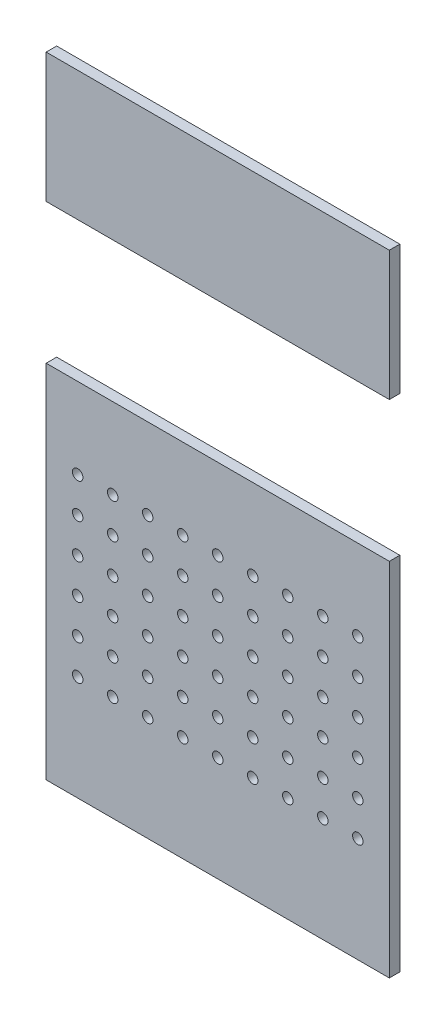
ISO-10303-21;
HEADER;
FILE_DESCRIPTION(('STEP AP214'),'2;1');
FILE_NAME('part.step','',(''),(''),'','','');
FILE_SCHEMA(('AUTOMOTIVE_DESIGN { 1 0 10303 214 1 1 1 1 }'));
ENDSEC;
DATA;
#1=APPLICATION_CONTEXT('core data for automotive mechanical design processes');
#2=APPLICATION_PROTOCOL_DEFINITION('international standard','automotive_design',2000,#1);
#3=PRODUCT_CONTEXT('',#1,'mechanical');
#4=PRODUCT('Part','Part','',(#3));
#5=PRODUCT_RELATED_PRODUCT_CATEGORY('part','',(#4));
#6=PRODUCT_DEFINITION_FORMATION('','',#4);
#7=PRODUCT_DEFINITION_CONTEXT('part definition',#1,'design');
#8=PRODUCT_DEFINITION('design','',#6,#7);
#9=PRODUCT_DEFINITION_SHAPE('','',#8);
#10=(LENGTH_UNIT() NAMED_UNIT(*) SI_UNIT(.MILLI.,.METRE.));
#11=(NAMED_UNIT(*) PLANE_ANGLE_UNIT() SI_UNIT($,.RADIAN.));
#12=(NAMED_UNIT(*) SI_UNIT($,.STERADIAN.) SOLID_ANGLE_UNIT());
#13=UNCERTAINTY_MEASURE_WITH_UNIT(LENGTH_MEASURE(1.E-05),#10,'distance_accuracy_value','');
#14=(GEOMETRIC_REPRESENTATION_CONTEXT(3) GLOBAL_UNCERTAINTY_ASSIGNED_CONTEXT((#13)) GLOBAL_UNIT_ASSIGNED_CONTEXT((#10,
#11,#12)) REPRESENTATION_CONTEXT('',''));
#15=CARTESIAN_POINT('',(0.,0.,0.));
#16=DIRECTION('',(0.,0.,1.));
#17=DIRECTION('',(1.,0.,0.));
#18=AXIS2_PLACEMENT_3D('',#15,#16,#17);
#19=CARTESIAN_POINT('',(0.,28.587602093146,3.));
#20=DIRECTION('',(0.,1.,0.));
#21=DIRECTION('',(-1.,0.,0.));
#22=AXIS2_PLACEMENT_3D('',#19,#20,#21);
#23=PLANE('',#22);
#24=DIRECTION('',(1.,0.,0.));
#25=VECTOR('',#24,1.);
#26=CARTESIAN_POINT('',(0.,28.587602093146,0.));
#27=LINE('',#26,#25);
#28=CARTESIAN_POINT('',(-23.4486966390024,28.587602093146,0.));
#29=VERTEX_POINT('',#28);
#30=CARTESIAN_POINT('',(74.5513033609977,28.587602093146,0.));
#31=VERTEX_POINT('',#30);
#32=EDGE_CURVE('E114',#29,#31,#27,.T.);
#33=ORIENTED_EDGE('',*,*,#32,.F.);
#34=DIRECTION('',(0.,0.,-1.));
#35=VECTOR('',#34,1.);
#36=CARTESIAN_POINT('',(-23.4486966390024,28.587602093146,3.));
#37=LINE('',#36,#35);
#38=CARTESIAN_POINT('',(-23.4486966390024,28.587602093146,3.));
#39=VERTEX_POINT('',#38);
#40=EDGE_CURVE('E12',#39,#29,#37,.T.);
#41=ORIENTED_EDGE('',*,*,#40,.F.);
#42=DIRECTION('',(1.,0.,0.));
#43=VECTOR('',#42,1.);
#44=CARTESIAN_POINT('',(0.,28.587602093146,3.));
#45=LINE('',#44,#43);
#46=CARTESIAN_POINT('',(74.5513033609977,28.587602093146,3.));
#47=VERTEX_POINT('',#46);
#48=EDGE_CURVE('E98',#39,#47,#45,.T.);
#49=ORIENTED_EDGE('',*,*,#48,.T.);
#50=DIRECTION('',(0.,0.,-1.));
#51=VECTOR('',#50,1.);
#52=CARTESIAN_POINT('',(74.5513033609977,28.587602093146,3.));
#53=LINE('',#52,#51);
#54=EDGE_CURVE('E60',#47,#31,#53,.T.);
#55=ORIENTED_EDGE('',*,*,#54,.T.);
#56=EDGE_LOOP('',(#33,#41,#49,#55));
#57=FACE_BOUND('',#56,.T.);
#58=ADVANCED_FACE('F43',(#57),#23,.T.);
#59=CARTESIAN_POINT('',(-23.4486966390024,0.,3.));
#60=DIRECTION('',(1.,0.,0.));
#61=DIRECTION('',(0.,1.,0.));
#62=AXIS2_PLACEMENT_3D('',#59,#60,#61);
#63=PLANE('',#62);
#64=DIRECTION('',(0.,-1.,0.));
#65=VECTOR('',#64,1.);
#66=CARTESIAN_POINT('',(-23.4486966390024,0.,0.));
#67=LINE('',#66,#65);
#68=CARTESIAN_POINT('',(-23.4486966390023,-74.466814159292,0.));
#69=VERTEX_POINT('',#68);
#70=EDGE_CURVE('E103',#29,#69,#67,.T.);
#71=ORIENTED_EDGE('',*,*,#70,.T.);
#72=DIRECTION('',(0.,0.,-1.));
#73=VECTOR('',#72,1.);
#74=CARTESIAN_POINT('',(-23.4486966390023,-74.466814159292,3.));
#75=LINE('',#74,#73);
#76=CARTESIAN_POINT('',(-23.4486966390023,-74.466814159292,3.));
#77=VERTEX_POINT('',#76);
#78=EDGE_CURVE('E52',#77,#69,#75,.T.);
#79=ORIENTED_EDGE('',*,*,#78,.F.);
#80=DIRECTION('',(0.,-1.,0.));
#81=VECTOR('',#80,1.);
#82=CARTESIAN_POINT('',(-23.4486966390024,0.,3.));
#83=LINE('',#82,#81);
#84=EDGE_CURVE('E94',#39,#77,#83,.T.);
#85=ORIENTED_EDGE('',*,*,#84,.F.);
#86=ORIENTED_EDGE('',*,*,#40,.T.);
#87=EDGE_LOOP('',(#71,#79,#85,#86));
#88=FACE_BOUND('',#87,.T.);
#89=ADVANCED_FACE('F101',(#88),#63,.F.);
#90=CARTESIAN_POINT('',(0.,-74.466814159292,3.));
#91=DIRECTION('',(0.,1.,0.));
#92=DIRECTION('',(0.,0.,1.));
#93=AXIS2_PLACEMENT_3D('',#90,#91,#92);
#94=PLANE('',#93);
#95=DIRECTION('',(1.,0.,0.));
#96=VECTOR('',#95,1.);
#97=CARTESIAN_POINT('',(0.,-74.466814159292,0.));
#98=LINE('',#97,#96);
#99=CARTESIAN_POINT('',(74.5513033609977,-74.466814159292,0.));
#100=VERTEX_POINT('',#99);
#101=EDGE_CURVE('E111',#69,#100,#98,.T.);
#102=ORIENTED_EDGE('',*,*,#101,.T.);
#103=DIRECTION('',(0.,0.,-1.));
#104=VECTOR('',#103,1.);
#105=CARTESIAN_POINT('',(74.5513033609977,-74.466814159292,3.));
#106=LINE('',#105,#104);
#107=CARTESIAN_POINT('',(74.5513033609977,-74.466814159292,3.));
#108=VERTEX_POINT('',#107);
#109=EDGE_CURVE('E74',#108,#100,#106,.T.);
#110=ORIENTED_EDGE('',*,*,#109,.F.);
#111=DIRECTION('',(1.,0.,0.));
#112=VECTOR('',#111,1.);
#113=CARTESIAN_POINT('',(0.,-74.466814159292,3.));
#114=LINE('',#113,#112);
#115=EDGE_CURVE('E86',#77,#108,#114,.T.);
#116=ORIENTED_EDGE('',*,*,#115,.F.);
#117=ORIENTED_EDGE('',*,*,#78,.T.);
#118=EDGE_LOOP('',(#102,#110,#116,#117));
#119=FACE_BOUND('',#118,.T.);
#120=ADVANCED_FACE('F88',(#119),#94,.F.);
#121=CARTESIAN_POINT('',(-14.4486966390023,-24.466814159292,3.));
#122=DIRECTION('',(0.,0.,-1.));
#123=DIRECTION('',(-1.,0.,0.));
#124=AXIS2_PLACEMENT_3D('',#121,#122,#123);
#125=CYLINDRICAL_SURFACE('',#124,1.5);
#126=CARTESIAN_POINT('',(-14.4486966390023,-24.466814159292,3.));
#127=DIRECTION('',(0.,0.,1.));
#128=DIRECTION('',(1.,0.,0.));
#129=AXIS2_PLACEMENT_3D('',#126,#127,#128);
#130=CIRCLE('',#129,1.5);
#131=CARTESIAN_POINT('',(-12.9486966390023,-24.466814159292,3.));
#132=VERTEX_POINT('',#131);
#133=EDGE_CURVE('E280',#132,#132,#130,.T.);
#134=ORIENTED_EDGE('',*,*,#133,.T.);
#135=EDGE_LOOP('',(#134));
#136=FACE_BOUND('',#135,.T.);
#137=CARTESIAN_POINT('',(-14.4486966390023,-24.466814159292,0.));
#138=DIRECTION('',(0.,0.,1.));
#139=DIRECTION('',(1.,0.,0.));
#140=AXIS2_PLACEMENT_3D('',#137,#138,#139);
#141=CIRCLE('',#140,1.5);
#142=CARTESIAN_POINT('',(-12.9486966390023,-24.466814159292,0.));
#143=VERTEX_POINT('',#142);
#144=EDGE_CURVE('E116',#143,#143,#141,.T.);
#145=ORIENTED_EDGE('',*,*,#144,.F.);
#146=EDGE_LOOP('',(#145));
#147=FACE_BOUND('',#146,.T.);
#148=ADVANCED_FACE('F555',(#136,#147),#125,.F.);
#149=CARTESIAN_POINT('',(-4.44869663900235,-24.466814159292,3.));
#150=DIRECTION('',(0.,0.,-1.));
#151=DIRECTION('',(-1.,0.,0.));
#152=AXIS2_PLACEMENT_3D('',#149,#150,#151);
#153=CYLINDRICAL_SURFACE('',#152,1.5);
#154=CARTESIAN_POINT('',(-4.44869663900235,-24.466814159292,3.));
#155=DIRECTION('',(0.,0.,1.));
#156=DIRECTION('',(1.,0.,0.));
#157=AXIS2_PLACEMENT_3D('',#154,#155,#156);
#158=CIRCLE('',#157,1.5);
#159=CARTESIAN_POINT('',(-2.94869663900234,-24.466814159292,3.));
#160=VERTEX_POINT('',#159);
#161=EDGE_CURVE('E283',#160,#160,#158,.T.);
#162=ORIENTED_EDGE('',*,*,#161,.T.);
#163=EDGE_LOOP('',(#162));
#164=FACE_BOUND('',#163,.T.);
#165=CARTESIAN_POINT('',(-4.44869663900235,-24.466814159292,0.));
#166=DIRECTION('',(0.,0.,1.));
#167=DIRECTION('',(1.,0.,0.));
#168=AXIS2_PLACEMENT_3D('',#165,#166,#167);
#169=CIRCLE('',#168,1.5);
#170=CARTESIAN_POINT('',(-2.94869663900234,-24.466814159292,0.));
#171=VERTEX_POINT('',#170);
#172=EDGE_CURVE('E119',#171,#171,#169,.T.);
#173=ORIENTED_EDGE('',*,*,#172,.F.);
#174=EDGE_LOOP('',(#173));
#175=FACE_BOUND('',#174,.T.);
#176=ADVANCED_FACE('F558',(#164,#175),#153,.F.);
#177=CARTESIAN_POINT('',(5.55130336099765,-24.466814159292,3.));
#178=DIRECTION('',(0.,0.,-1.));
#179=DIRECTION('',(-1.,0.,0.));
#180=AXIS2_PLACEMENT_3D('',#177,#178,#179);
#181=CYLINDRICAL_SURFACE('',#180,1.5);
#182=CARTESIAN_POINT('',(5.55130336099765,-24.466814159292,3.));
#183=DIRECTION('',(0.,0.,1.));
#184=DIRECTION('',(1.,0.,0.));
#185=AXIS2_PLACEMENT_3D('',#182,#183,#184);
#186=CIRCLE('',#185,1.5);
#187=CARTESIAN_POINT('',(7.05130336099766,-24.466814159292,3.));
#188=VERTEX_POINT('',#187);
#189=EDGE_CURVE('E286',#188,#188,#186,.T.);
#190=ORIENTED_EDGE('',*,*,#189,.T.);
#191=EDGE_LOOP('',(#190));
#192=FACE_BOUND('',#191,.T.);
#193=CARTESIAN_POINT('',(5.55130336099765,-24.466814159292,0.));
#194=DIRECTION('',(0.,0.,1.));
#195=DIRECTION('',(1.,0.,0.));
#196=AXIS2_PLACEMENT_3D('',#193,#194,#195);
#197=CIRCLE('',#196,1.5);
#198=CARTESIAN_POINT('',(7.05130336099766,-24.466814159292,0.));
#199=VERTEX_POINT('',#198);
#200=EDGE_CURVE('E122',#199,#199,#197,.T.);
#201=ORIENTED_EDGE('',*,*,#200,.F.);
#202=EDGE_LOOP('',(#201));
#203=FACE_BOUND('',#202,.T.);
#204=ADVANCED_FACE('F582',(#192,#203),#181,.F.);
#205=CARTESIAN_POINT('',(15.5513033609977,-24.466814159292,3.));
#206=DIRECTION('',(0.,0.,-1.));
#207=DIRECTION('',(-1.,0.,0.));
#208=AXIS2_PLACEMENT_3D('',#205,#206,#207);
#209=CYLINDRICAL_SURFACE('',#208,1.5);
#210=CARTESIAN_POINT('',(15.5513033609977,-24.466814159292,3.));
#211=DIRECTION('',(0.,0.,1.));
#212=DIRECTION('',(1.,0.,0.));
#213=AXIS2_PLACEMENT_3D('',#210,#211,#212);
#214=CIRCLE('',#213,1.5);
#215=CARTESIAN_POINT('',(17.0513033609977,-24.466814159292,3.));
#216=VERTEX_POINT('',#215);
#217=EDGE_CURVE('E289',#216,#216,#214,.T.);
#218=ORIENTED_EDGE('',*,*,#217,.T.);
#219=EDGE_LOOP('',(#218));
#220=FACE_BOUND('',#219,.T.);
#221=CARTESIAN_POINT('',(15.5513033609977,-24.466814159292,0.));
#222=DIRECTION('',(0.,0.,1.));
#223=DIRECTION('',(1.,0.,0.));
#224=AXIS2_PLACEMENT_3D('',#221,#222,#223);
#225=CIRCLE('',#224,1.5);
#226=CARTESIAN_POINT('',(17.0513033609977,-24.466814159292,0.));
#227=VERTEX_POINT('',#226);
#228=EDGE_CURVE('E125',#227,#227,#225,.T.);
#229=ORIENTED_EDGE('',*,*,#228,.F.);
#230=EDGE_LOOP('',(#229));
#231=FACE_BOUND('',#230,.T.);
#232=ADVANCED_FACE('F586',(#220,#231),#209,.F.);
#233=CARTESIAN_POINT('',(25.5513033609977,-24.466814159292,3.));
#234=DIRECTION('',(0.,0.,-1.));
#235=DIRECTION('',(-1.,0.,0.));
#236=AXIS2_PLACEMENT_3D('',#233,#234,#235);
#237=CYLINDRICAL_SURFACE('',#236,1.5);
#238=CARTESIAN_POINT('',(25.5513033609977,-24.466814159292,3.));
#239=DIRECTION('',(0.,0.,1.));
#240=DIRECTION('',(1.,0.,0.));
#241=AXIS2_PLACEMENT_3D('',#238,#239,#240);
#242=CIRCLE('',#241,1.5);
#243=CARTESIAN_POINT('',(27.0513033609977,-24.466814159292,3.));
#244=VERTEX_POINT('',#243);
#245=EDGE_CURVE('E292',#244,#244,#242,.T.);
#246=ORIENTED_EDGE('',*,*,#245,.T.);
#247=EDGE_LOOP('',(#246));
#248=FACE_BOUND('',#247,.T.);
#249=CARTESIAN_POINT('',(25.5513033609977,-24.466814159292,0.));
#250=DIRECTION('',(0.,0.,1.));
#251=DIRECTION('',(1.,0.,0.));
#252=AXIS2_PLACEMENT_3D('',#249,#250,#251);
#253=CIRCLE('',#252,1.5);
#254=CARTESIAN_POINT('',(27.0513033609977,-24.466814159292,0.));
#255=VERTEX_POINT('',#254);
#256=EDGE_CURVE('E128',#255,#255,#253,.T.);
#257=ORIENTED_EDGE('',*,*,#256,.F.);
#258=EDGE_LOOP('',(#257));
#259=FACE_BOUND('',#258,.T.);
#260=ADVANCED_FACE('F590',(#248,#259),#237,.F.);
#261=CARTESIAN_POINT('',(35.5513033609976,-24.466814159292,3.));
#262=DIRECTION('',(0.,0.,-1.));
#263=DIRECTION('',(-1.,0.,0.));
#264=AXIS2_PLACEMENT_3D('',#261,#262,#263);
#265=CYLINDRICAL_SURFACE('',#264,1.5);
#266=CARTESIAN_POINT('',(35.5513033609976,-24.466814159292,3.));
#267=DIRECTION('',(0.,0.,1.));
#268=DIRECTION('',(1.,0.,0.));
#269=AXIS2_PLACEMENT_3D('',#266,#267,#268);
#270=CIRCLE('',#269,1.5);
#271=CARTESIAN_POINT('',(37.0513033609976,-24.466814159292,3.));
#272=VERTEX_POINT('',#271);
#273=EDGE_CURVE('E295',#272,#272,#270,.T.);
#274=ORIENTED_EDGE('',*,*,#273,.T.);
#275=EDGE_LOOP('',(#274));
#276=FACE_BOUND('',#275,.T.);
#277=CARTESIAN_POINT('',(35.5513033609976,-24.466814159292,0.));
#278=DIRECTION('',(0.,0.,1.));
#279=DIRECTION('',(1.,0.,0.));
#280=AXIS2_PLACEMENT_3D('',#277,#278,#279);
#281=CIRCLE('',#280,1.5);
#282=CARTESIAN_POINT('',(37.0513033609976,-24.466814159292,0.));
#283=VERTEX_POINT('',#282);
#284=EDGE_CURVE('E131',#283,#283,#281,.T.);
#285=ORIENTED_EDGE('',*,*,#284,.F.);
#286=EDGE_LOOP('',(#285));
#287=FACE_BOUND('',#286,.T.);
#288=ADVANCED_FACE('F594',(#276,#287),#265,.F.);
#289=CARTESIAN_POINT('',(45.5513033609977,-24.466814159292,3.));
#290=DIRECTION('',(0.,0.,-1.));
#291=DIRECTION('',(-1.,0.,0.));
#292=AXIS2_PLACEMENT_3D('',#289,#290,#291);
#293=CYLINDRICAL_SURFACE('',#292,1.5);
#294=CARTESIAN_POINT('',(45.5513033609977,-24.466814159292,3.));
#295=DIRECTION('',(0.,0.,1.));
#296=DIRECTION('',(1.,0.,0.));
#297=AXIS2_PLACEMENT_3D('',#294,#295,#296);
#298=CIRCLE('',#297,1.5);
#299=CARTESIAN_POINT('',(47.0513033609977,-24.466814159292,3.));
#300=VERTEX_POINT('',#299);
#301=EDGE_CURVE('E298',#300,#300,#298,.T.);
#302=ORIENTED_EDGE('',*,*,#301,.T.);
#303=EDGE_LOOP('',(#302));
#304=FACE_BOUND('',#303,.T.);
#305=CARTESIAN_POINT('',(45.5513033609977,-24.466814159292,0.));
#306=DIRECTION('',(0.,0.,1.));
#307=DIRECTION('',(1.,0.,0.));
#308=AXIS2_PLACEMENT_3D('',#305,#306,#307);
#309=CIRCLE('',#308,1.5);
#310=CARTESIAN_POINT('',(47.0513033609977,-24.466814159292,0.));
#311=VERTEX_POINT('',#310);
#312=EDGE_CURVE('E134',#311,#311,#309,.T.);
#313=ORIENTED_EDGE('',*,*,#312,.F.);
#314=EDGE_LOOP('',(#313));
#315=FACE_BOUND('',#314,.T.);
#316=ADVANCED_FACE('F598',(#304,#315),#293,.F.);
#317=CARTESIAN_POINT('',(55.5513033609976,-24.466814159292,3.));
#318=DIRECTION('',(0.,0.,-1.));
#319=DIRECTION('',(-1.,0.,0.));
#320=AXIS2_PLACEMENT_3D('',#317,#318,#319);
#321=CYLINDRICAL_SURFACE('',#320,1.5);
#322=CARTESIAN_POINT('',(55.5513033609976,-24.466814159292,3.));
#323=DIRECTION('',(0.,0.,1.));
#324=DIRECTION('',(1.,0.,0.));
#325=AXIS2_PLACEMENT_3D('',#322,#323,#324);
#326=CIRCLE('',#325,1.5);
#327=CARTESIAN_POINT('',(57.0513033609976,-24.466814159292,3.));
#328=VERTEX_POINT('',#327);
#329=EDGE_CURVE('E301',#328,#328,#326,.T.);
#330=ORIENTED_EDGE('',*,*,#329,.T.);
#331=EDGE_LOOP('',(#330));
#332=FACE_BOUND('',#331,.T.);
#333=CARTESIAN_POINT('',(55.5513033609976,-24.466814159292,0.));
#334=DIRECTION('',(0.,0.,1.));
#335=DIRECTION('',(1.,0.,0.));
#336=AXIS2_PLACEMENT_3D('',#333,#334,#335);
#337=CIRCLE('',#336,1.5);
#338=CARTESIAN_POINT('',(57.0513033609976,-24.466814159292,0.));
#339=VERTEX_POINT('',#338);
#340=EDGE_CURVE('E137',#339,#339,#337,.T.);
#341=ORIENTED_EDGE('',*,*,#340,.F.);
#342=EDGE_LOOP('',(#341));
#343=FACE_BOUND('',#342,.T.);
#344=ADVANCED_FACE('F602',(#332,#343),#321,.F.);
#345=CARTESIAN_POINT('',(65.5513033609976,-24.466814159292,3.));
#346=DIRECTION('',(0.,0.,-1.));
#347=DIRECTION('',(-1.,0.,0.));
#348=AXIS2_PLACEMENT_3D('',#345,#346,#347);
#349=CYLINDRICAL_SURFACE('',#348,1.5);
#350=CARTESIAN_POINT('',(65.5513033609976,-24.466814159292,3.));
#351=DIRECTION('',(0.,0.,1.));
#352=DIRECTION('',(1.,0.,0.));
#353=AXIS2_PLACEMENT_3D('',#350,#351,#352);
#354=CIRCLE('',#353,1.5);
#355=CARTESIAN_POINT('',(67.0513033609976,-24.466814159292,3.));
#356=VERTEX_POINT('',#355);
#357=EDGE_CURVE('E304',#356,#356,#354,.T.);
#358=ORIENTED_EDGE('',*,*,#357,.T.);
#359=EDGE_LOOP('',(#358));
#360=FACE_BOUND('',#359,.T.);
#361=CARTESIAN_POINT('',(65.5513033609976,-24.466814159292,0.));
#362=DIRECTION('',(0.,0.,1.));
#363=DIRECTION('',(1.,0.,0.));
#364=AXIS2_PLACEMENT_3D('',#361,#362,#363);
#365=CIRCLE('',#364,1.5);
#366=CARTESIAN_POINT('',(67.0513033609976,-24.466814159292,0.));
#367=VERTEX_POINT('',#366);
#368=EDGE_CURVE('E140',#367,#367,#365,.T.);
#369=ORIENTED_EDGE('',*,*,#368,.F.);
#370=EDGE_LOOP('',(#369));
#371=FACE_BOUND('',#370,.T.);
#372=ADVANCED_FACE('F606',(#360,#371),#349,.F.);
#373=CARTESIAN_POINT('',(-4.44869663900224,-34.466814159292,3.));
#374=DIRECTION('',(0.,0.,-1.));
#375=DIRECTION('',(-1.,0.,0.));
#376=AXIS2_PLACEMENT_3D('',#373,#374,#375);
#377=CYLINDRICAL_SURFACE('',#376,1.5);
#378=CARTESIAN_POINT('',(-4.44869663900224,-34.466814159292,3.));
#379=DIRECTION('',(0.,0.,1.));
#380=DIRECTION('',(1.,0.,0.));
#381=AXIS2_PLACEMENT_3D('',#378,#379,#380);
#382=CIRCLE('',#381,1.5);
#383=CARTESIAN_POINT('',(-2.94869663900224,-34.466814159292,3.));
#384=VERTEX_POINT('',#383);
#385=EDGE_CURVE('E307',#384,#384,#382,.T.);
#386=ORIENTED_EDGE('',*,*,#385,.T.);
#387=EDGE_LOOP('',(#386));
#388=FACE_BOUND('',#387,.T.);
#389=CARTESIAN_POINT('',(-4.44869663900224,-34.466814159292,0.));
#390=DIRECTION('',(0.,0.,1.));
#391=DIRECTION('',(1.,0.,0.));
#392=AXIS2_PLACEMENT_3D('',#389,#390,#391);
#393=CIRCLE('',#392,1.5);
#394=CARTESIAN_POINT('',(-2.94869663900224,-34.466814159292,0.));
#395=VERTEX_POINT('',#394);
#396=EDGE_CURVE('E143',#395,#395,#393,.T.);
#397=ORIENTED_EDGE('',*,*,#396,.F.);
#398=EDGE_LOOP('',(#397));
#399=FACE_BOUND('',#398,.T.);
#400=ADVANCED_FACE('F610',(#388,#399),#377,.F.);
#401=CARTESIAN_POINT('',(5.55130336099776,-34.466814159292,3.));
#402=DIRECTION('',(0.,0.,-1.));
#403=DIRECTION('',(-1.,0.,0.));
#404=AXIS2_PLACEMENT_3D('',#401,#402,#403);
#405=CYLINDRICAL_SURFACE('',#404,1.5);
#406=CARTESIAN_POINT('',(5.55130336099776,-34.466814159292,3.));
#407=DIRECTION('',(0.,0.,1.));
#408=DIRECTION('',(1.,0.,0.));
#409=AXIS2_PLACEMENT_3D('',#406,#407,#408);
#410=CIRCLE('',#409,1.5);
#411=CARTESIAN_POINT('',(7.05130336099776,-34.466814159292,3.));
#412=VERTEX_POINT('',#411);
#413=EDGE_CURVE('E310',#412,#412,#410,.T.);
#414=ORIENTED_EDGE('',*,*,#413,.T.);
#415=EDGE_LOOP('',(#414));
#416=FACE_BOUND('',#415,.T.);
#417=CARTESIAN_POINT('',(5.55130336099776,-34.466814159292,0.));
#418=DIRECTION('',(0.,0.,1.));
#419=DIRECTION('',(1.,0.,0.));
#420=AXIS2_PLACEMENT_3D('',#417,#418,#419);
#421=CIRCLE('',#420,1.5);
#422=CARTESIAN_POINT('',(7.05130336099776,-34.466814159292,0.));
#423=VERTEX_POINT('',#422);
#424=EDGE_CURVE('E146',#423,#423,#421,.T.);
#425=ORIENTED_EDGE('',*,*,#424,.F.);
#426=EDGE_LOOP('',(#425));
#427=FACE_BOUND('',#426,.T.);
#428=ADVANCED_FACE('F614',(#416,#427),#405,.F.);
#429=CARTESIAN_POINT('',(15.5513033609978,-34.466814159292,3.));
#430=DIRECTION('',(0.,0.,-1.));
#431=DIRECTION('',(-1.,0.,0.));
#432=AXIS2_PLACEMENT_3D('',#429,#430,#431);
#433=CYLINDRICAL_SURFACE('',#432,1.5);
#434=CARTESIAN_POINT('',(15.5513033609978,-34.466814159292,3.));
#435=DIRECTION('',(0.,0.,1.));
#436=DIRECTION('',(1.,0.,0.));
#437=AXIS2_PLACEMENT_3D('',#434,#435,#436);
#438=CIRCLE('',#437,1.5);
#439=CARTESIAN_POINT('',(17.0513033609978,-34.466814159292,3.));
#440=VERTEX_POINT('',#439);
#441=EDGE_CURVE('E313',#440,#440,#438,.T.);
#442=ORIENTED_EDGE('',*,*,#441,.T.);
#443=EDGE_LOOP('',(#442));
#444=FACE_BOUND('',#443,.T.);
#445=CARTESIAN_POINT('',(15.5513033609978,-34.466814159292,0.));
#446=DIRECTION('',(0.,0.,1.));
#447=DIRECTION('',(1.,0.,0.));
#448=AXIS2_PLACEMENT_3D('',#445,#446,#447);
#449=CIRCLE('',#448,1.5);
#450=CARTESIAN_POINT('',(17.0513033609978,-34.466814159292,0.));
#451=VERTEX_POINT('',#450);
#452=EDGE_CURVE('E149',#451,#451,#449,.T.);
#453=ORIENTED_EDGE('',*,*,#452,.F.);
#454=EDGE_LOOP('',(#453));
#455=FACE_BOUND('',#454,.T.);
#456=ADVANCED_FACE('F618',(#444,#455),#433,.F.);
#457=CARTESIAN_POINT('',(25.5513033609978,-34.466814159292,3.));
#458=DIRECTION('',(0.,0.,-1.));
#459=DIRECTION('',(-1.,0.,0.));
#460=AXIS2_PLACEMENT_3D('',#457,#458,#459);
#461=CYLINDRICAL_SURFACE('',#460,1.5);
#462=CARTESIAN_POINT('',(25.5513033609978,-34.466814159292,3.));
#463=DIRECTION('',(0.,0.,1.));
#464=DIRECTION('',(1.,0.,0.));
#465=AXIS2_PLACEMENT_3D('',#462,#463,#464);
#466=CIRCLE('',#465,1.5);
#467=CARTESIAN_POINT('',(27.0513033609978,-34.466814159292,3.));
#468=VERTEX_POINT('',#467);
#469=EDGE_CURVE('E316',#468,#468,#466,.T.);
#470=ORIENTED_EDGE('',*,*,#469,.T.);
#471=EDGE_LOOP('',(#470));
#472=FACE_BOUND('',#471,.T.);
#473=CARTESIAN_POINT('',(25.5513033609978,-34.466814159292,0.));
#474=DIRECTION('',(0.,0.,1.));
#475=DIRECTION('',(1.,0.,0.));
#476=AXIS2_PLACEMENT_3D('',#473,#474,#475);
#477=CIRCLE('',#476,1.5);
#478=CARTESIAN_POINT('',(27.0513033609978,-34.466814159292,0.));
#479=VERTEX_POINT('',#478);
#480=EDGE_CURVE('E152',#479,#479,#477,.T.);
#481=ORIENTED_EDGE('',*,*,#480,.F.);
#482=EDGE_LOOP('',(#481));
#483=FACE_BOUND('',#482,.T.);
#484=ADVANCED_FACE('F622',(#472,#483),#461,.F.);
#485=CARTESIAN_POINT('',(35.5513033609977,-34.466814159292,3.));
#486=DIRECTION('',(0.,0.,-1.));
#487=DIRECTION('',(-1.,0.,0.));
#488=AXIS2_PLACEMENT_3D('',#485,#486,#487);
#489=CYLINDRICAL_SURFACE('',#488,1.5);
#490=CARTESIAN_POINT('',(35.5513033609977,-34.466814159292,3.));
#491=DIRECTION('',(0.,0.,1.));
#492=DIRECTION('',(1.,0.,0.));
#493=AXIS2_PLACEMENT_3D('',#490,#491,#492);
#494=CIRCLE('',#493,1.5);
#495=CARTESIAN_POINT('',(37.0513033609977,-34.466814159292,3.));
#496=VERTEX_POINT('',#495);
#497=EDGE_CURVE('E319',#496,#496,#494,.T.);
#498=ORIENTED_EDGE('',*,*,#497,.T.);
#499=EDGE_LOOP('',(#498));
#500=FACE_BOUND('',#499,.T.);
#501=CARTESIAN_POINT('',(35.5513033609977,-34.466814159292,0.));
#502=DIRECTION('',(0.,0.,1.));
#503=DIRECTION('',(1.,0.,0.));
#504=AXIS2_PLACEMENT_3D('',#501,#502,#503);
#505=CIRCLE('',#504,1.5);
#506=CARTESIAN_POINT('',(37.0513033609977,-34.466814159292,0.));
#507=VERTEX_POINT('',#506);
#508=EDGE_CURVE('E155',#507,#507,#505,.T.);
#509=ORIENTED_EDGE('',*,*,#508,.F.);
#510=EDGE_LOOP('',(#509));
#511=FACE_BOUND('',#510,.T.);
#512=ADVANCED_FACE('F626',(#500,#511),#489,.F.);
#513=CARTESIAN_POINT('',(45.5513033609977,-34.466814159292,3.));
#514=DIRECTION('',(0.,0.,-1.));
#515=DIRECTION('',(-1.,0.,0.));
#516=AXIS2_PLACEMENT_3D('',#513,#514,#515);
#517=CYLINDRICAL_SURFACE('',#516,1.5);
#518=CARTESIAN_POINT('',(45.5513033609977,-34.466814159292,3.));
#519=DIRECTION('',(0.,0.,1.));
#520=DIRECTION('',(1.,0.,0.));
#521=AXIS2_PLACEMENT_3D('',#518,#519,#520);
#522=CIRCLE('',#521,1.5);
#523=CARTESIAN_POINT('',(47.0513033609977,-34.466814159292,3.));
#524=VERTEX_POINT('',#523);
#525=EDGE_CURVE('E322',#524,#524,#522,.T.);
#526=ORIENTED_EDGE('',*,*,#525,.T.);
#527=EDGE_LOOP('',(#526));
#528=FACE_BOUND('',#527,.T.);
#529=CARTESIAN_POINT('',(45.5513033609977,-34.466814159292,0.));
#530=DIRECTION('',(0.,0.,1.));
#531=DIRECTION('',(1.,0.,0.));
#532=AXIS2_PLACEMENT_3D('',#529,#530,#531);
#533=CIRCLE('',#532,1.5);
#534=CARTESIAN_POINT('',(47.0513033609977,-34.466814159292,0.));
#535=VERTEX_POINT('',#534);
#536=EDGE_CURVE('E158',#535,#535,#533,.T.);
#537=ORIENTED_EDGE('',*,*,#536,.F.);
#538=EDGE_LOOP('',(#537));
#539=FACE_BOUND('',#538,.T.);
#540=ADVANCED_FACE('F630',(#528,#539),#517,.F.);
#541=CARTESIAN_POINT('',(55.5513033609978,-34.466814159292,3.));
#542=DIRECTION('',(0.,0.,-1.));
#543=DIRECTION('',(-1.,0.,0.));
#544=AXIS2_PLACEMENT_3D('',#541,#542,#543);
#545=CYLINDRICAL_SURFACE('',#544,1.5);
#546=CARTESIAN_POINT('',(55.5513033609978,-34.466814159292,3.));
#547=DIRECTION('',(0.,0.,1.));
#548=DIRECTION('',(1.,0.,0.));
#549=AXIS2_PLACEMENT_3D('',#546,#547,#548);
#550=CIRCLE('',#549,1.5);
#551=CARTESIAN_POINT('',(57.0513033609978,-34.466814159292,3.));
#552=VERTEX_POINT('',#551);
#553=EDGE_CURVE('E325',#552,#552,#550,.T.);
#554=ORIENTED_EDGE('',*,*,#553,.T.);
#555=EDGE_LOOP('',(#554));
#556=FACE_BOUND('',#555,.T.);
#557=CARTESIAN_POINT('',(55.5513033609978,-34.466814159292,0.));
#558=DIRECTION('',(0.,0.,1.));
#559=DIRECTION('',(1.,0.,0.));
#560=AXIS2_PLACEMENT_3D('',#557,#558,#559);
#561=CIRCLE('',#560,1.5);
#562=CARTESIAN_POINT('',(57.0513033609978,-34.466814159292,0.));
#563=VERTEX_POINT('',#562);
#564=EDGE_CURVE('E161',#563,#563,#561,.T.);
#565=ORIENTED_EDGE('',*,*,#564,.F.);
#566=EDGE_LOOP('',(#565));
#567=FACE_BOUND('',#566,.T.);
#568=ADVANCED_FACE('F634',(#556,#567),#545,.F.);
#569=CARTESIAN_POINT('',(65.5513033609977,-34.466814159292,3.));
#570=DIRECTION('',(0.,0.,-1.));
#571=DIRECTION('',(-1.,0.,0.));
#572=AXIS2_PLACEMENT_3D('',#569,#570,#571);
#573=CYLINDRICAL_SURFACE('',#572,1.5);
#574=CARTESIAN_POINT('',(65.5513033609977,-34.466814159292,3.));
#575=DIRECTION('',(0.,0.,1.));
#576=DIRECTION('',(1.,0.,0.));
#577=AXIS2_PLACEMENT_3D('',#574,#575,#576);
#578=CIRCLE('',#577,1.5);
#579=CARTESIAN_POINT('',(67.0513033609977,-34.466814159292,3.));
#580=VERTEX_POINT('',#579);
#581=EDGE_CURVE('E328',#580,#580,#578,.T.);
#582=ORIENTED_EDGE('',*,*,#581,.T.);
#583=EDGE_LOOP('',(#582));
#584=FACE_BOUND('',#583,.T.);
#585=CARTESIAN_POINT('',(65.5513033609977,-34.466814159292,0.));
#586=DIRECTION('',(0.,0.,1.));
#587=DIRECTION('',(1.,0.,0.));
#588=AXIS2_PLACEMENT_3D('',#585,#586,#587);
#589=CIRCLE('',#588,1.5);
#590=CARTESIAN_POINT('',(67.0513033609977,-34.466814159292,0.));
#591=VERTEX_POINT('',#590);
#592=EDGE_CURVE('E164',#591,#591,#589,.T.);
#593=ORIENTED_EDGE('',*,*,#592,.F.);
#594=EDGE_LOOP('',(#593));
#595=FACE_BOUND('',#594,.T.);
#596=ADVANCED_FACE('F638',(#584,#595),#573,.F.);
#597=CARTESIAN_POINT('',(-4.44869663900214,-44.466814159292,3.));
#598=DIRECTION('',(0.,0.,-1.));
#599=DIRECTION('',(-1.,0.,0.));
#600=AXIS2_PLACEMENT_3D('',#597,#598,#599);
#601=CYLINDRICAL_SURFACE('',#600,1.5);
#602=CARTESIAN_POINT('',(-4.44869663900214,-44.466814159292,3.));
#603=DIRECTION('',(0.,0.,1.));
#604=DIRECTION('',(1.,0.,0.));
#605=AXIS2_PLACEMENT_3D('',#602,#603,#604);
#606=CIRCLE('',#605,1.5);
#607=CARTESIAN_POINT('',(-2.94869663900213,-44.466814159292,3.));
#608=VERTEX_POINT('',#607);
#609=EDGE_CURVE('E331',#608,#608,#606,.T.);
#610=ORIENTED_EDGE('',*,*,#609,.T.);
#611=EDGE_LOOP('',(#610));
#612=FACE_BOUND('',#611,.T.);
#613=CARTESIAN_POINT('',(-4.44869663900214,-44.466814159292,0.));
#614=DIRECTION('',(0.,0.,1.));
#615=DIRECTION('',(1.,0.,0.));
#616=AXIS2_PLACEMENT_3D('',#613,#614,#615);
#617=CIRCLE('',#616,1.5);
#618=CARTESIAN_POINT('',(-2.94869663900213,-44.466814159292,0.));
#619=VERTEX_POINT('',#618);
#620=EDGE_CURVE('E167',#619,#619,#617,.T.);
#621=ORIENTED_EDGE('',*,*,#620,.F.);
#622=EDGE_LOOP('',(#621));
#623=FACE_BOUND('',#622,.T.);
#624=ADVANCED_FACE('F642',(#612,#623),#601,.F.);
#625=CARTESIAN_POINT('',(5.55130336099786,-44.466814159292,3.));
#626=DIRECTION('',(0.,0.,-1.));
#627=DIRECTION('',(-1.,0.,0.));
#628=AXIS2_PLACEMENT_3D('',#625,#626,#627);
#629=CYLINDRICAL_SURFACE('',#628,1.5);
#630=CARTESIAN_POINT('',(5.55130336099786,-44.466814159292,3.));
#631=DIRECTION('',(0.,0.,1.));
#632=DIRECTION('',(1.,0.,0.));
#633=AXIS2_PLACEMENT_3D('',#630,#631,#632);
#634=CIRCLE('',#633,1.5);
#635=CARTESIAN_POINT('',(7.05130336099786,-44.466814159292,3.));
#636=VERTEX_POINT('',#635);
#637=EDGE_CURVE('E334',#636,#636,#634,.T.);
#638=ORIENTED_EDGE('',*,*,#637,.T.);
#639=EDGE_LOOP('',(#638));
#640=FACE_BOUND('',#639,.T.);
#641=CARTESIAN_POINT('',(5.55130336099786,-44.466814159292,0.));
#642=DIRECTION('',(0.,0.,1.));
#643=DIRECTION('',(1.,0.,0.));
#644=AXIS2_PLACEMENT_3D('',#641,#642,#643);
#645=CIRCLE('',#644,1.5);
#646=CARTESIAN_POINT('',(7.05130336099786,-44.466814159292,0.));
#647=VERTEX_POINT('',#646);
#648=EDGE_CURVE('E170',#647,#647,#645,.T.);
#649=ORIENTED_EDGE('',*,*,#648,.F.);
#650=EDGE_LOOP('',(#649));
#651=FACE_BOUND('',#650,.T.);
#652=ADVANCED_FACE('F646',(#640,#651),#629,.F.);
#653=CARTESIAN_POINT('',(15.5513033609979,-44.466814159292,3.));
#654=DIRECTION('',(0.,0.,-1.));
#655=DIRECTION('',(-1.,0.,0.));
#656=AXIS2_PLACEMENT_3D('',#653,#654,#655);
#657=CYLINDRICAL_SURFACE('',#656,1.5);
#658=CARTESIAN_POINT('',(15.5513033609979,-44.466814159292,3.));
#659=DIRECTION('',(0.,0.,1.));
#660=DIRECTION('',(1.,0.,0.));
#661=AXIS2_PLACEMENT_3D('',#658,#659,#660);
#662=CIRCLE('',#661,1.5);
#663=CARTESIAN_POINT('',(17.0513033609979,-44.466814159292,3.));
#664=VERTEX_POINT('',#663);
#665=EDGE_CURVE('E337',#664,#664,#662,.T.);
#666=ORIENTED_EDGE('',*,*,#665,.T.);
#667=EDGE_LOOP('',(#666));
#668=FACE_BOUND('',#667,.T.);
#669=CARTESIAN_POINT('',(15.5513033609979,-44.466814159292,0.));
#670=DIRECTION('',(0.,0.,1.));
#671=DIRECTION('',(1.,0.,0.));
#672=AXIS2_PLACEMENT_3D('',#669,#670,#671);
#673=CIRCLE('',#672,1.5);
#674=CARTESIAN_POINT('',(17.0513033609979,-44.466814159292,0.));
#675=VERTEX_POINT('',#674);
#676=EDGE_CURVE('E173',#675,#675,#673,.T.);
#677=ORIENTED_EDGE('',*,*,#676,.F.);
#678=EDGE_LOOP('',(#677));
#679=FACE_BOUND('',#678,.T.);
#680=ADVANCED_FACE('F650',(#668,#679),#657,.F.);
#681=CARTESIAN_POINT('',(25.5513033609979,-44.466814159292,3.));
#682=DIRECTION('',(0.,0.,-1.));
#683=DIRECTION('',(-1.,0.,0.));
#684=AXIS2_PLACEMENT_3D('',#681,#682,#683);
#685=CYLINDRICAL_SURFACE('',#684,1.5);
#686=CARTESIAN_POINT('',(25.5513033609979,-44.466814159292,3.));
#687=DIRECTION('',(0.,0.,1.));
#688=DIRECTION('',(1.,0.,0.));
#689=AXIS2_PLACEMENT_3D('',#686,#687,#688);
#690=CIRCLE('',#689,1.5);
#691=CARTESIAN_POINT('',(27.0513033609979,-44.466814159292,3.));
#692=VERTEX_POINT('',#691);
#693=EDGE_CURVE('E340',#692,#692,#690,.T.);
#694=ORIENTED_EDGE('',*,*,#693,.T.);
#695=EDGE_LOOP('',(#694));
#696=FACE_BOUND('',#695,.T.);
#697=CARTESIAN_POINT('',(25.5513033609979,-44.466814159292,0.));
#698=DIRECTION('',(0.,0.,1.));
#699=DIRECTION('',(1.,0.,0.));
#700=AXIS2_PLACEMENT_3D('',#697,#698,#699);
#701=CIRCLE('',#700,1.5);
#702=CARTESIAN_POINT('',(27.0513033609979,-44.466814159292,0.));
#703=VERTEX_POINT('',#702);
#704=EDGE_CURVE('E176',#703,#703,#701,.T.);
#705=ORIENTED_EDGE('',*,*,#704,.F.);
#706=EDGE_LOOP('',(#705));
#707=FACE_BOUND('',#706,.T.);
#708=ADVANCED_FACE('F654',(#696,#707),#685,.F.);
#709=CARTESIAN_POINT('',(35.5513033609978,-44.466814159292,3.));
#710=DIRECTION('',(0.,0.,-1.));
#711=DIRECTION('',(-1.,0.,0.));
#712=AXIS2_PLACEMENT_3D('',#709,#710,#711);
#713=CYLINDRICAL_SURFACE('',#712,1.5);
#714=CARTESIAN_POINT('',(35.5513033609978,-44.466814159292,3.));
#715=DIRECTION('',(0.,0.,1.));
#716=DIRECTION('',(1.,0.,0.));
#717=AXIS2_PLACEMENT_3D('',#714,#715,#716);
#718=CIRCLE('',#717,1.5);
#719=CARTESIAN_POINT('',(37.0513033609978,-44.466814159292,3.));
#720=VERTEX_POINT('',#719);
#721=EDGE_CURVE('E343',#720,#720,#718,.T.);
#722=ORIENTED_EDGE('',*,*,#721,.T.);
#723=EDGE_LOOP('',(#722));
#724=FACE_BOUND('',#723,.T.);
#725=CARTESIAN_POINT('',(35.5513033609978,-44.466814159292,0.));
#726=DIRECTION('',(0.,0.,1.));
#727=DIRECTION('',(1.,0.,0.));
#728=AXIS2_PLACEMENT_3D('',#725,#726,#727);
#729=CIRCLE('',#728,1.5);
#730=CARTESIAN_POINT('',(37.0513033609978,-44.466814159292,0.));
#731=VERTEX_POINT('',#730);
#732=EDGE_CURVE('E179',#731,#731,#729,.T.);
#733=ORIENTED_EDGE('',*,*,#732,.F.);
#734=EDGE_LOOP('',(#733));
#735=FACE_BOUND('',#734,.T.);
#736=ADVANCED_FACE('F658',(#724,#735),#713,.F.);
#737=CARTESIAN_POINT('',(45.5513033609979,-44.466814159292,3.));
#738=DIRECTION('',(0.,0.,-1.));
#739=DIRECTION('',(-1.,0.,0.));
#740=AXIS2_PLACEMENT_3D('',#737,#738,#739);
#741=CYLINDRICAL_SURFACE('',#740,1.5);
#742=CARTESIAN_POINT('',(45.5513033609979,-44.466814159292,3.));
#743=DIRECTION('',(0.,0.,1.));
#744=DIRECTION('',(1.,0.,0.));
#745=AXIS2_PLACEMENT_3D('',#742,#743,#744);
#746=CIRCLE('',#745,1.5);
#747=CARTESIAN_POINT('',(47.0513033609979,-44.466814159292,3.));
#748=VERTEX_POINT('',#747);
#749=EDGE_CURVE('E346',#748,#748,#746,.T.);
#750=ORIENTED_EDGE('',*,*,#749,.T.);
#751=EDGE_LOOP('',(#750));
#752=FACE_BOUND('',#751,.T.);
#753=CARTESIAN_POINT('',(45.5513033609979,-44.466814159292,0.));
#754=DIRECTION('',(0.,0.,1.));
#755=DIRECTION('',(1.,0.,0.));
#756=AXIS2_PLACEMENT_3D('',#753,#754,#755);
#757=CIRCLE('',#756,1.5);
#758=CARTESIAN_POINT('',(47.0513033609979,-44.466814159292,0.));
#759=VERTEX_POINT('',#758);
#760=EDGE_CURVE('E182',#759,#759,#757,.T.);
#761=ORIENTED_EDGE('',*,*,#760,.F.);
#762=EDGE_LOOP('',(#761));
#763=FACE_BOUND('',#762,.T.);
#764=ADVANCED_FACE('F662',(#752,#763),#741,.F.);
#765=CARTESIAN_POINT('',(55.5513033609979,-44.466814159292,3.));
#766=DIRECTION('',(0.,0.,-1.));
#767=DIRECTION('',(-1.,0.,0.));
#768=AXIS2_PLACEMENT_3D('',#765,#766,#767);
#769=CYLINDRICAL_SURFACE('',#768,1.5);
#770=CARTESIAN_POINT('',(55.5513033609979,-44.466814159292,3.));
#771=DIRECTION('',(0.,0.,1.));
#772=DIRECTION('',(1.,0.,0.));
#773=AXIS2_PLACEMENT_3D('',#770,#771,#772);
#774=CIRCLE('',#773,1.5);
#775=CARTESIAN_POINT('',(57.0513033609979,-44.466814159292,3.));
#776=VERTEX_POINT('',#775);
#777=EDGE_CURVE('E349',#776,#776,#774,.T.);
#778=ORIENTED_EDGE('',*,*,#777,.T.);
#779=EDGE_LOOP('',(#778));
#780=FACE_BOUND('',#779,.T.);
#781=CARTESIAN_POINT('',(55.5513033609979,-44.466814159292,0.));
#782=DIRECTION('',(0.,0.,1.));
#783=DIRECTION('',(1.,0.,0.));
#784=AXIS2_PLACEMENT_3D('',#781,#782,#783);
#785=CIRCLE('',#784,1.5);
#786=CARTESIAN_POINT('',(57.0513033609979,-44.466814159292,0.));
#787=VERTEX_POINT('',#786);
#788=EDGE_CURVE('E185',#787,#787,#785,.T.);
#789=ORIENTED_EDGE('',*,*,#788,.F.);
#790=EDGE_LOOP('',(#789));
#791=FACE_BOUND('',#790,.T.);
#792=ADVANCED_FACE('F666',(#780,#791),#769,.F.);
#793=CARTESIAN_POINT('',(65.5513033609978,-44.466814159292,3.));
#794=DIRECTION('',(0.,0.,-1.));
#795=DIRECTION('',(-1.,0.,0.));
#796=AXIS2_PLACEMENT_3D('',#793,#794,#795);
#797=CYLINDRICAL_SURFACE('',#796,1.5);
#798=CARTESIAN_POINT('',(65.5513033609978,-44.466814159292,3.));
#799=DIRECTION('',(0.,0.,1.));
#800=DIRECTION('',(1.,0.,0.));
#801=AXIS2_PLACEMENT_3D('',#798,#799,#800);
#802=CIRCLE('',#801,1.5);
#803=CARTESIAN_POINT('',(67.0513033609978,-44.466814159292,3.));
#804=VERTEX_POINT('',#803);
#805=EDGE_CURVE('E352',#804,#804,#802,.T.);
#806=ORIENTED_EDGE('',*,*,#805,.T.);
#807=EDGE_LOOP('',(#806));
#808=FACE_BOUND('',#807,.T.);
#809=CARTESIAN_POINT('',(65.5513033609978,-44.466814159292,0.));
#810=DIRECTION('',(0.,0.,1.));
#811=DIRECTION('',(1.,0.,0.));
#812=AXIS2_PLACEMENT_3D('',#809,#810,#811);
#813=CIRCLE('',#812,1.5);
#814=CARTESIAN_POINT('',(67.0513033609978,-44.466814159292,0.));
#815=VERTEX_POINT('',#814);
#816=EDGE_CURVE('E188',#815,#815,#813,.T.);
#817=ORIENTED_EDGE('',*,*,#816,.F.);
#818=EDGE_LOOP('',(#817));
#819=FACE_BOUND('',#818,.T.);
#820=ADVANCED_FACE('F670',(#808,#819),#797,.F.);
#821=CARTESIAN_POINT('',(-14.4486966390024,-14.466814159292,3.));
#822=DIRECTION('',(0.,0.,-1.));
#823=DIRECTION('',(-1.,0.,0.));
#824=AXIS2_PLACEMENT_3D('',#821,#822,#823);
#825=CYLINDRICAL_SURFACE('',#824,1.5);
#826=CARTESIAN_POINT('',(-14.4486966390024,-14.466814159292,3.));
#827=DIRECTION('',(0.,0.,1.));
#828=DIRECTION('',(1.,0.,0.));
#829=AXIS2_PLACEMENT_3D('',#826,#827,#828);
#830=CIRCLE('',#829,1.5);
#831=CARTESIAN_POINT('',(-12.9486966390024,-14.466814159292,3.));
#832=VERTEX_POINT('',#831);
#833=EDGE_CURVE('E355',#832,#832,#830,.T.);
#834=ORIENTED_EDGE('',*,*,#833,.T.);
#835=EDGE_LOOP('',(#834));
#836=FACE_BOUND('',#835,.T.);
#837=CARTESIAN_POINT('',(-14.4486966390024,-14.466814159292,0.));
#838=DIRECTION('',(0.,0.,1.));
#839=DIRECTION('',(1.,0.,0.));
#840=AXIS2_PLACEMENT_3D('',#837,#838,#839);
#841=CIRCLE('',#840,1.5);
#842=CARTESIAN_POINT('',(-12.9486966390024,-14.466814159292,0.));
#843=VERTEX_POINT('',#842);
#844=EDGE_CURVE('E191',#843,#843,#841,.T.);
#845=ORIENTED_EDGE('',*,*,#844,.F.);
#846=EDGE_LOOP('',(#845));
#847=FACE_BOUND('',#846,.T.);
#848=ADVANCED_FACE('F674',(#836,#847),#825,.F.);
#849=CARTESIAN_POINT('',(-4.44869663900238,-14.466814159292,3.));
#850=DIRECTION('',(0.,0.,-1.));
#851=DIRECTION('',(-1.,0.,0.));
#852=AXIS2_PLACEMENT_3D('',#849,#850,#851);
#853=CYLINDRICAL_SURFACE('',#852,1.5);
#854=CARTESIAN_POINT('',(-4.44869663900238,-14.466814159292,3.));
#855=DIRECTION('',(0.,0.,1.));
#856=DIRECTION('',(1.,0.,0.));
#857=AXIS2_PLACEMENT_3D('',#854,#855,#856);
#858=CIRCLE('',#857,1.5);
#859=CARTESIAN_POINT('',(-2.94869663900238,-14.466814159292,3.));
#860=VERTEX_POINT('',#859);
#861=EDGE_CURVE('E358',#860,#860,#858,.T.);
#862=ORIENTED_EDGE('',*,*,#861,.T.);
#863=EDGE_LOOP('',(#862));
#864=FACE_BOUND('',#863,.T.);
#865=CARTESIAN_POINT('',(-4.44869663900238,-14.466814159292,0.));
#866=DIRECTION('',(0.,0.,1.));
#867=DIRECTION('',(1.,0.,0.));
#868=AXIS2_PLACEMENT_3D('',#865,#866,#867);
#869=CIRCLE('',#868,1.5);
#870=CARTESIAN_POINT('',(-2.94869663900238,-14.466814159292,0.));
#871=VERTEX_POINT('',#870);
#872=EDGE_CURVE('E194',#871,#871,#869,.T.);
#873=ORIENTED_EDGE('',*,*,#872,.F.);
#874=EDGE_LOOP('',(#873));
#875=FACE_BOUND('',#874,.T.);
#876=ADVANCED_FACE('F678',(#864,#875),#853,.F.);
#877=CARTESIAN_POINT('',(5.55130336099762,-14.466814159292,3.));
#878=DIRECTION('',(0.,0.,-1.));
#879=DIRECTION('',(-1.,0.,0.));
#880=AXIS2_PLACEMENT_3D('',#877,#878,#879);
#881=CYLINDRICAL_SURFACE('',#880,1.5);
#882=CARTESIAN_POINT('',(5.55130336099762,-14.466814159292,3.));
#883=DIRECTION('',(0.,0.,1.));
#884=DIRECTION('',(1.,0.,0.));
#885=AXIS2_PLACEMENT_3D('',#882,#883,#884);
#886=CIRCLE('',#885,1.5);
#887=CARTESIAN_POINT('',(7.05130336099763,-14.466814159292,3.));
#888=VERTEX_POINT('',#887);
#889=EDGE_CURVE('E361',#888,#888,#886,.T.);
#890=ORIENTED_EDGE('',*,*,#889,.T.);
#891=EDGE_LOOP('',(#890));
#892=FACE_BOUND('',#891,.T.);
#893=CARTESIAN_POINT('',(5.55130336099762,-14.466814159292,0.));
#894=DIRECTION('',(0.,0.,1.));
#895=DIRECTION('',(1.,0.,0.));
#896=AXIS2_PLACEMENT_3D('',#893,#894,#895);
#897=CIRCLE('',#896,1.5);
#898=CARTESIAN_POINT('',(7.05130336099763,-14.466814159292,0.));
#899=VERTEX_POINT('',#898);
#900=EDGE_CURVE('E197',#899,#899,#897,.T.);
#901=ORIENTED_EDGE('',*,*,#900,.F.);
#902=EDGE_LOOP('',(#901));
#903=FACE_BOUND('',#902,.T.);
#904=ADVANCED_FACE('F682',(#892,#903),#881,.F.);
#905=CARTESIAN_POINT('',(15.5513033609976,-14.466814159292,3.));
#906=DIRECTION('',(0.,0.,-1.));
#907=DIRECTION('',(-1.,0.,0.));
#908=AXIS2_PLACEMENT_3D('',#905,#906,#907);
#909=CYLINDRICAL_SURFACE('',#908,1.5);
#910=CARTESIAN_POINT('',(15.5513033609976,-14.466814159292,3.));
#911=DIRECTION('',(0.,0.,1.));
#912=DIRECTION('',(1.,0.,0.));
#913=AXIS2_PLACEMENT_3D('',#910,#911,#912);
#914=CIRCLE('',#913,1.5);
#915=CARTESIAN_POINT('',(17.0513033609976,-14.466814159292,3.));
#916=VERTEX_POINT('',#915);
#917=EDGE_CURVE('E364',#916,#916,#914,.T.);
#918=ORIENTED_EDGE('',*,*,#917,.T.);
#919=EDGE_LOOP('',(#918));
#920=FACE_BOUND('',#919,.T.);
#921=CARTESIAN_POINT('',(15.5513033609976,-14.466814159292,0.));
#922=DIRECTION('',(0.,0.,1.));
#923=DIRECTION('',(1.,0.,0.));
#924=AXIS2_PLACEMENT_3D('',#921,#922,#923);
#925=CIRCLE('',#924,1.5);
#926=CARTESIAN_POINT('',(17.0513033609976,-14.466814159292,0.));
#927=VERTEX_POINT('',#926);
#928=EDGE_CURVE('E200',#927,#927,#925,.T.);
#929=ORIENTED_EDGE('',*,*,#928,.F.);
#930=EDGE_LOOP('',(#929));
#931=FACE_BOUND('',#930,.T.);
#932=ADVANCED_FACE('F686',(#920,#931),#909,.F.);
#933=CARTESIAN_POINT('',(25.5513033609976,-14.466814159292,3.));
#934=DIRECTION('',(0.,0.,-1.));
#935=DIRECTION('',(-1.,0.,0.));
#936=AXIS2_PLACEMENT_3D('',#933,#934,#935);
#937=CYLINDRICAL_SURFACE('',#936,1.5);
#938=CARTESIAN_POINT('',(25.5513033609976,-14.466814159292,3.));
#939=DIRECTION('',(0.,0.,1.));
#940=DIRECTION('',(1.,0.,0.));
#941=AXIS2_PLACEMENT_3D('',#938,#939,#940);
#942=CIRCLE('',#941,1.5);
#943=CARTESIAN_POINT('',(27.0513033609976,-14.466814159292,3.));
#944=VERTEX_POINT('',#943);
#945=EDGE_CURVE('E367',#944,#944,#942,.T.);
#946=ORIENTED_EDGE('',*,*,#945,.T.);
#947=EDGE_LOOP('',(#946));
#948=FACE_BOUND('',#947,.T.);
#949=CARTESIAN_POINT('',(25.5513033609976,-14.466814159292,0.));
#950=DIRECTION('',(0.,0.,1.));
#951=DIRECTION('',(1.,0.,0.));
#952=AXIS2_PLACEMENT_3D('',#949,#950,#951);
#953=CIRCLE('',#952,1.5);
#954=CARTESIAN_POINT('',(27.0513033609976,-14.466814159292,0.));
#955=VERTEX_POINT('',#954);
#956=EDGE_CURVE('E203',#955,#955,#953,.T.);
#957=ORIENTED_EDGE('',*,*,#956,.F.);
#958=EDGE_LOOP('',(#957));
#959=FACE_BOUND('',#958,.T.);
#960=ADVANCED_FACE('F690',(#948,#959),#937,.F.);
#961=CARTESIAN_POINT('',(35.5513033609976,-14.466814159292,3.));
#962=DIRECTION('',(0.,0.,-1.));
#963=DIRECTION('',(-1.,0.,0.));
#964=AXIS2_PLACEMENT_3D('',#961,#962,#963);
#965=CYLINDRICAL_SURFACE('',#964,1.5);
#966=CARTESIAN_POINT('',(35.5513033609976,-14.466814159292,3.));
#967=DIRECTION('',(0.,0.,1.));
#968=DIRECTION('',(1.,0.,0.));
#969=AXIS2_PLACEMENT_3D('',#966,#967,#968);
#970=CIRCLE('',#969,1.5);
#971=CARTESIAN_POINT('',(37.0513033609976,-14.466814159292,3.));
#972=VERTEX_POINT('',#971);
#973=EDGE_CURVE('E370',#972,#972,#970,.T.);
#974=ORIENTED_EDGE('',*,*,#973,.T.);
#975=EDGE_LOOP('',(#974));
#976=FACE_BOUND('',#975,.T.);
#977=CARTESIAN_POINT('',(35.5513033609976,-14.466814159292,0.));
#978=DIRECTION('',(0.,0.,1.));
#979=DIRECTION('',(1.,0.,0.));
#980=AXIS2_PLACEMENT_3D('',#977,#978,#979);
#981=CIRCLE('',#980,1.5);
#982=CARTESIAN_POINT('',(37.0513033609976,-14.466814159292,0.));
#983=VERTEX_POINT('',#982);
#984=EDGE_CURVE('E206',#983,#983,#981,.T.);
#985=ORIENTED_EDGE('',*,*,#984,.F.);
#986=EDGE_LOOP('',(#985));
#987=FACE_BOUND('',#986,.T.);
#988=ADVANCED_FACE('F694',(#976,#987),#965,.F.);
#989=CARTESIAN_POINT('',(45.5513033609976,-14.466814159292,3.));
#990=DIRECTION('',(0.,0.,-1.));
#991=DIRECTION('',(-1.,0.,0.));
#992=AXIS2_PLACEMENT_3D('',#989,#990,#991);
#993=CYLINDRICAL_SURFACE('',#992,1.5);
#994=CARTESIAN_POINT('',(45.5513033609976,-14.466814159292,3.));
#995=DIRECTION('',(0.,0.,1.));
#996=DIRECTION('',(1.,0.,0.));
#997=AXIS2_PLACEMENT_3D('',#994,#995,#996);
#998=CIRCLE('',#997,1.5);
#999=CARTESIAN_POINT('',(47.0513033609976,-14.466814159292,3.));
#1000=VERTEX_POINT('',#999);
#1001=EDGE_CURVE('E373',#1000,#1000,#998,.T.);
#1002=ORIENTED_EDGE('',*,*,#1001,.T.);
#1003=EDGE_LOOP('',(#1002));
#1004=FACE_BOUND('',#1003,.T.);
#1005=CARTESIAN_POINT('',(45.5513033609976,-14.466814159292,0.));
#1006=DIRECTION('',(0.,0.,1.));
#1007=DIRECTION('',(1.,0.,0.));
#1008=AXIS2_PLACEMENT_3D('',#1005,#1006,#1007);
#1009=CIRCLE('',#1008,1.5);
#1010=CARTESIAN_POINT('',(47.0513033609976,-14.466814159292,0.));
#1011=VERTEX_POINT('',#1010);
#1012=EDGE_CURVE('E209',#1011,#1011,#1009,.T.);
#1013=ORIENTED_EDGE('',*,*,#1012,.F.);
#1014=EDGE_LOOP('',(#1013));
#1015=FACE_BOUND('',#1014,.T.);
#1016=ADVANCED_FACE('F698',(#1004,#1015),#993,.F.);
#1017=CARTESIAN_POINT('',(55.5513033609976,-14.466814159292,3.));
#1018=DIRECTION('',(0.,0.,-1.));
#1019=DIRECTION('',(-1.,0.,0.));
#1020=AXIS2_PLACEMENT_3D('',#1017,#1018,#1019);
#1021=CYLINDRICAL_SURFACE('',#1020,1.5);
#1022=CARTESIAN_POINT('',(55.5513033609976,-14.466814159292,3.));
#1023=DIRECTION('',(0.,0.,1.));
#1024=DIRECTION('',(1.,0.,0.));
#1025=AXIS2_PLACEMENT_3D('',#1022,#1023,#1024);
#1026=CIRCLE('',#1025,1.5);
#1027=CARTESIAN_POINT('',(57.0513033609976,-14.466814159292,3.));
#1028=VERTEX_POINT('',#1027);
#1029=EDGE_CURVE('E376',#1028,#1028,#1026,.T.);
#1030=ORIENTED_EDGE('',*,*,#1029,.T.);
#1031=EDGE_LOOP('',(#1030));
#1032=FACE_BOUND('',#1031,.T.);
#1033=CARTESIAN_POINT('',(55.5513033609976,-14.466814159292,0.));
#1034=DIRECTION('',(0.,0.,1.));
#1035=DIRECTION('',(1.,0.,0.));
#1036=AXIS2_PLACEMENT_3D('',#1033,#1034,#1035);
#1037=CIRCLE('',#1036,1.5);
#1038=CARTESIAN_POINT('',(57.0513033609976,-14.466814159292,0.));
#1039=VERTEX_POINT('',#1038);
#1040=EDGE_CURVE('E212',#1039,#1039,#1037,.T.);
#1041=ORIENTED_EDGE('',*,*,#1040,.F.);
#1042=EDGE_LOOP('',(#1041));
#1043=FACE_BOUND('',#1042,.T.);
#1044=ADVANCED_FACE('F702',(#1032,#1043),#1021,.F.);
#1045=CARTESIAN_POINT('',(65.5513033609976,-14.466814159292,3.));
#1046=DIRECTION('',(0.,0.,-1.));
#1047=DIRECTION('',(-1.,0.,0.));
#1048=AXIS2_PLACEMENT_3D('',#1045,#1046,#1047);
#1049=CYLINDRICAL_SURFACE('',#1048,1.5);
#1050=CARTESIAN_POINT('',(65.5513033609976,-14.466814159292,3.));
#1051=DIRECTION('',(0.,0.,1.));
#1052=DIRECTION('',(1.,0.,0.));
#1053=AXIS2_PLACEMENT_3D('',#1050,#1051,#1052);
#1054=CIRCLE('',#1053,1.5);
#1055=CARTESIAN_POINT('',(67.0513033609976,-14.466814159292,3.));
#1056=VERTEX_POINT('',#1055);
#1057=EDGE_CURVE('E379',#1056,#1056,#1054,.T.);
#1058=ORIENTED_EDGE('',*,*,#1057,.T.);
#1059=EDGE_LOOP('',(#1058));
#1060=FACE_BOUND('',#1059,.T.);
#1061=CARTESIAN_POINT('',(65.5513033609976,-14.466814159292,0.));
#1062=DIRECTION('',(0.,0.,1.));
#1063=DIRECTION('',(1.,0.,0.));
#1064=AXIS2_PLACEMENT_3D('',#1061,#1062,#1063);
#1065=CIRCLE('',#1064,1.5);
#1066=CARTESIAN_POINT('',(67.0513033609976,-14.466814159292,0.));
#1067=VERTEX_POINT('',#1066);
#1068=EDGE_CURVE('E215',#1067,#1067,#1065,.T.);
#1069=ORIENTED_EDGE('',*,*,#1068,.F.);
#1070=EDGE_LOOP('',(#1069));
#1071=FACE_BOUND('',#1070,.T.);
#1072=ADVANCED_FACE('F706',(#1060,#1071),#1049,.F.);
#1073=CARTESIAN_POINT('',(-4.44869663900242,-4.46681415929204,3.));
#1074=DIRECTION('',(0.,0.,-1.));
#1075=DIRECTION('',(-1.,0.,0.));
#1076=AXIS2_PLACEMENT_3D('',#1073,#1074,#1075);
#1077=CYLINDRICAL_SURFACE('',#1076,1.5);
#1078=CARTESIAN_POINT('',(-4.44869663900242,-4.46681415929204,3.));
#1079=DIRECTION('',(0.,0.,1.));
#1080=DIRECTION('',(1.,0.,0.));
#1081=AXIS2_PLACEMENT_3D('',#1078,#1079,#1080);
#1082=CIRCLE('',#1081,1.5);
#1083=CARTESIAN_POINT('',(-2.94869663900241,-4.46681415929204,3.));
#1084=VERTEX_POINT('',#1083);
#1085=EDGE_CURVE('E382',#1084,#1084,#1082,.T.);
#1086=ORIENTED_EDGE('',*,*,#1085,.T.);
#1087=EDGE_LOOP('',(#1086));
#1088=FACE_BOUND('',#1087,.T.);
#1089=CARTESIAN_POINT('',(-4.44869663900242,-4.46681415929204,0.));
#1090=DIRECTION('',(0.,0.,1.));
#1091=DIRECTION('',(1.,0.,0.));
#1092=AXIS2_PLACEMENT_3D('',#1089,#1090,#1091);
#1093=CIRCLE('',#1092,1.5);
#1094=CARTESIAN_POINT('',(-2.94869663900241,-4.46681415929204,0.));
#1095=VERTEX_POINT('',#1094);
#1096=EDGE_CURVE('E218',#1095,#1095,#1093,.T.);
#1097=ORIENTED_EDGE('',*,*,#1096,.F.);
#1098=EDGE_LOOP('',(#1097));
#1099=FACE_BOUND('',#1098,.T.);
#1100=ADVANCED_FACE('F710',(#1088,#1099),#1077,.F.);
#1101=CARTESIAN_POINT('',(5.55130336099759,-4.46681415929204,3.));
#1102=DIRECTION('',(0.,0.,-1.));
#1103=DIRECTION('',(-1.,0.,0.));
#1104=AXIS2_PLACEMENT_3D('',#1101,#1102,#1103);
#1105=CYLINDRICAL_SURFACE('',#1104,1.5);
#1106=CARTESIAN_POINT('',(5.55130336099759,-4.46681415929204,3.));
#1107=DIRECTION('',(0.,0.,1.));
#1108=DIRECTION('',(1.,0.,0.));
#1109=AXIS2_PLACEMENT_3D('',#1106,#1107,#1108);
#1110=CIRCLE('',#1109,1.5);
#1111=CARTESIAN_POINT('',(7.05130336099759,-4.46681415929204,3.));
#1112=VERTEX_POINT('',#1111);
#1113=EDGE_CURVE('E385',#1112,#1112,#1110,.T.);
#1114=ORIENTED_EDGE('',*,*,#1113,.T.);
#1115=EDGE_LOOP('',(#1114));
#1116=FACE_BOUND('',#1115,.T.);
#1117=CARTESIAN_POINT('',(5.55130336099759,-4.46681415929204,0.));
#1118=DIRECTION('',(0.,0.,1.));
#1119=DIRECTION('',(1.,0.,0.));
#1120=AXIS2_PLACEMENT_3D('',#1117,#1118,#1119);
#1121=CIRCLE('',#1120,1.5);
#1122=CARTESIAN_POINT('',(7.05130336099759,-4.46681415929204,0.));
#1123=VERTEX_POINT('',#1122);
#1124=EDGE_CURVE('E221',#1123,#1123,#1121,.T.);
#1125=ORIENTED_EDGE('',*,*,#1124,.F.);
#1126=EDGE_LOOP('',(#1125));
#1127=FACE_BOUND('',#1126,.T.);
#1128=ADVANCED_FACE('F714',(#1116,#1127),#1105,.F.);
#1129=CARTESIAN_POINT('',(15.5513033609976,-4.46681415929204,3.));
#1130=DIRECTION('',(0.,0.,-1.));
#1131=DIRECTION('',(-1.,0.,0.));
#1132=AXIS2_PLACEMENT_3D('',#1129,#1130,#1131);
#1133=CYLINDRICAL_SURFACE('',#1132,1.5);
#1134=CARTESIAN_POINT('',(15.5513033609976,-4.46681415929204,3.));
#1135=DIRECTION('',(0.,0.,1.));
#1136=DIRECTION('',(1.,0.,0.));
#1137=AXIS2_PLACEMENT_3D('',#1134,#1135,#1136);
#1138=CIRCLE('',#1137,1.5);
#1139=CARTESIAN_POINT('',(17.0513033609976,-4.46681415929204,3.));
#1140=VERTEX_POINT('',#1139);
#1141=EDGE_CURVE('E388',#1140,#1140,#1138,.T.);
#1142=ORIENTED_EDGE('',*,*,#1141,.T.);
#1143=EDGE_LOOP('',(#1142));
#1144=FACE_BOUND('',#1143,.T.);
#1145=CARTESIAN_POINT('',(15.5513033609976,-4.46681415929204,0.));
#1146=DIRECTION('',(0.,0.,1.));
#1147=DIRECTION('',(1.,0.,0.));
#1148=AXIS2_PLACEMENT_3D('',#1145,#1146,#1147);
#1149=CIRCLE('',#1148,1.5);
#1150=CARTESIAN_POINT('',(17.0513033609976,-4.46681415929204,0.));
#1151=VERTEX_POINT('',#1150);
#1152=EDGE_CURVE('E224',#1151,#1151,#1149,.T.);
#1153=ORIENTED_EDGE('',*,*,#1152,.F.);
#1154=EDGE_LOOP('',(#1153));
#1155=FACE_BOUND('',#1154,.T.);
#1156=ADVANCED_FACE('F718',(#1144,#1155),#1133,.F.);
#1157=CARTESIAN_POINT('',(25.5513033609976,-4.46681415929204,3.));
#1158=DIRECTION('',(0.,0.,-1.));
#1159=DIRECTION('',(-1.,0.,0.));
#1160=AXIS2_PLACEMENT_3D('',#1157,#1158,#1159);
#1161=CYLINDRICAL_SURFACE('',#1160,1.5);
#1162=CARTESIAN_POINT('',(25.5513033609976,-4.46681415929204,3.));
#1163=DIRECTION('',(0.,0.,1.));
#1164=DIRECTION('',(1.,0.,0.));
#1165=AXIS2_PLACEMENT_3D('',#1162,#1163,#1164);
#1166=CIRCLE('',#1165,1.5);
#1167=CARTESIAN_POINT('',(27.0513033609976,-4.46681415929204,3.));
#1168=VERTEX_POINT('',#1167);
#1169=EDGE_CURVE('E391',#1168,#1168,#1166,.T.);
#1170=ORIENTED_EDGE('',*,*,#1169,.T.);
#1171=EDGE_LOOP('',(#1170));
#1172=FACE_BOUND('',#1171,.T.);
#1173=CARTESIAN_POINT('',(25.5513033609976,-4.46681415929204,0.));
#1174=DIRECTION('',(0.,0.,1.));
#1175=DIRECTION('',(1.,0.,0.));
#1176=AXIS2_PLACEMENT_3D('',#1173,#1174,#1175);
#1177=CIRCLE('',#1176,1.5);
#1178=CARTESIAN_POINT('',(27.0513033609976,-4.46681415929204,0.));
#1179=VERTEX_POINT('',#1178);
#1180=EDGE_CURVE('E227',#1179,#1179,#1177,.T.);
#1181=ORIENTED_EDGE('',*,*,#1180,.F.);
#1182=EDGE_LOOP('',(#1181));
#1183=FACE_BOUND('',#1182,.T.);
#1184=ADVANCED_FACE('F722',(#1172,#1183),#1161,.F.);
#1185=CARTESIAN_POINT('',(35.5513033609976,-4.46681415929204,3.));
#1186=DIRECTION('',(0.,0.,-1.));
#1187=DIRECTION('',(-1.,0.,0.));
#1188=AXIS2_PLACEMENT_3D('',#1185,#1186,#1187);
#1189=CYLINDRICAL_SURFACE('',#1188,1.5);
#1190=CARTESIAN_POINT('',(35.5513033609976,-4.46681415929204,3.));
#1191=DIRECTION('',(0.,0.,1.));
#1192=DIRECTION('',(1.,0.,0.));
#1193=AXIS2_PLACEMENT_3D('',#1190,#1191,#1192);
#1194=CIRCLE('',#1193,1.5);
#1195=CARTESIAN_POINT('',(37.0513033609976,-4.46681415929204,3.));
#1196=VERTEX_POINT('',#1195);
#1197=EDGE_CURVE('E394',#1196,#1196,#1194,.T.);
#1198=ORIENTED_EDGE('',*,*,#1197,.T.);
#1199=EDGE_LOOP('',(#1198));
#1200=FACE_BOUND('',#1199,.T.);
#1201=CARTESIAN_POINT('',(35.5513033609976,-4.46681415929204,0.));
#1202=DIRECTION('',(0.,0.,1.));
#1203=DIRECTION('',(1.,0.,0.));
#1204=AXIS2_PLACEMENT_3D('',#1201,#1202,#1203);
#1205=CIRCLE('',#1204,1.5);
#1206=CARTESIAN_POINT('',(37.0513033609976,-4.46681415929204,0.));
#1207=VERTEX_POINT('',#1206);
#1208=EDGE_CURVE('E230',#1207,#1207,#1205,.T.);
#1209=ORIENTED_EDGE('',*,*,#1208,.F.);
#1210=EDGE_LOOP('',(#1209));
#1211=FACE_BOUND('',#1210,.T.);
#1212=ADVANCED_FACE('F726',(#1200,#1211),#1189,.F.);
#1213=CARTESIAN_POINT('',(45.5513033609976,-4.46681415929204,3.));
#1214=DIRECTION('',(0.,0.,-1.));
#1215=DIRECTION('',(-1.,0.,0.));
#1216=AXIS2_PLACEMENT_3D('',#1213,#1214,#1215);
#1217=CYLINDRICAL_SURFACE('',#1216,1.5);
#1218=CARTESIAN_POINT('',(45.5513033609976,-4.46681415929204,3.));
#1219=DIRECTION('',(0.,0.,1.));
#1220=DIRECTION('',(1.,0.,0.));
#1221=AXIS2_PLACEMENT_3D('',#1218,#1219,#1220);
#1222=CIRCLE('',#1221,1.5);
#1223=CARTESIAN_POINT('',(47.0513033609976,-4.46681415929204,3.));
#1224=VERTEX_POINT('',#1223);
#1225=EDGE_CURVE('E397',#1224,#1224,#1222,.T.);
#1226=ORIENTED_EDGE('',*,*,#1225,.T.);
#1227=EDGE_LOOP('',(#1226));
#1228=FACE_BOUND('',#1227,.T.);
#1229=CARTESIAN_POINT('',(45.5513033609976,-4.46681415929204,0.));
#1230=DIRECTION('',(0.,0.,1.));
#1231=DIRECTION('',(1.,0.,0.));
#1232=AXIS2_PLACEMENT_3D('',#1229,#1230,#1231);
#1233=CIRCLE('',#1232,1.5);
#1234=CARTESIAN_POINT('',(47.0513033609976,-4.46681415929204,0.));
#1235=VERTEX_POINT('',#1234);
#1236=EDGE_CURVE('E233',#1235,#1235,#1233,.T.);
#1237=ORIENTED_EDGE('',*,*,#1236,.F.);
#1238=EDGE_LOOP('',(#1237));
#1239=FACE_BOUND('',#1238,.T.);
#1240=ADVANCED_FACE('F730',(#1228,#1239),#1217,.F.);
#1241=CARTESIAN_POINT('',(55.5513033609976,-4.46681415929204,3.));
#1242=DIRECTION('',(0.,0.,-1.));
#1243=DIRECTION('',(-1.,0.,0.));
#1244=AXIS2_PLACEMENT_3D('',#1241,#1242,#1243);
#1245=CYLINDRICAL_SURFACE('',#1244,1.5);
#1246=CARTESIAN_POINT('',(55.5513033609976,-4.46681415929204,3.));
#1247=DIRECTION('',(0.,0.,1.));
#1248=DIRECTION('',(1.,0.,0.));
#1249=AXIS2_PLACEMENT_3D('',#1246,#1247,#1248);
#1250=CIRCLE('',#1249,1.5);
#1251=CARTESIAN_POINT('',(57.0513033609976,-4.46681415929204,3.));
#1252=VERTEX_POINT('',#1251);
#1253=EDGE_CURVE('E400',#1252,#1252,#1250,.T.);
#1254=ORIENTED_EDGE('',*,*,#1253,.T.);
#1255=EDGE_LOOP('',(#1254));
#1256=FACE_BOUND('',#1255,.T.);
#1257=CARTESIAN_POINT('',(55.5513033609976,-4.46681415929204,0.));
#1258=DIRECTION('',(0.,0.,1.));
#1259=DIRECTION('',(1.,0.,0.));
#1260=AXIS2_PLACEMENT_3D('',#1257,#1258,#1259);
#1261=CIRCLE('',#1260,1.5);
#1262=CARTESIAN_POINT('',(57.0513033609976,-4.46681415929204,0.));
#1263=VERTEX_POINT('',#1262);
#1264=EDGE_CURVE('E236',#1263,#1263,#1261,.T.);
#1265=ORIENTED_EDGE('',*,*,#1264,.F.);
#1266=EDGE_LOOP('',(#1265));
#1267=FACE_BOUND('',#1266,.T.);
#1268=ADVANCED_FACE('F734',(#1256,#1267),#1245,.F.);
#1269=CARTESIAN_POINT('',(-14.4486966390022,-34.466814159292,3.));
#1270=DIRECTION('',(0.,0.,-1.));
#1271=DIRECTION('',(-1.,0.,0.));
#1272=AXIS2_PLACEMENT_3D('',#1269,#1270,#1271);
#1273=CYLINDRICAL_SURFACE('',#1272,1.5);
#1274=CARTESIAN_POINT('',(-14.4486966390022,-34.466814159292,3.));
#1275=DIRECTION('',(0.,0.,1.));
#1276=DIRECTION('',(1.,0.,0.));
#1277=AXIS2_PLACEMENT_3D('',#1274,#1275,#1276);
#1278=CIRCLE('',#1277,1.5);
#1279=CARTESIAN_POINT('',(-12.9486966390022,-34.466814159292,3.));
#1280=VERTEX_POINT('',#1279);
#1281=EDGE_CURVE('E403',#1280,#1280,#1278,.T.);
#1282=ORIENTED_EDGE('',*,*,#1281,.T.);
#1283=EDGE_LOOP('',(#1282));
#1284=FACE_BOUND('',#1283,.T.);
#1285=CARTESIAN_POINT('',(-14.4486966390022,-34.466814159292,0.));
#1286=DIRECTION('',(0.,0.,1.));
#1287=DIRECTION('',(1.,0.,0.));
#1288=AXIS2_PLACEMENT_3D('',#1285,#1286,#1287);
#1289=CIRCLE('',#1288,1.5);
#1290=CARTESIAN_POINT('',(-12.9486966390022,-34.466814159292,0.));
#1291=VERTEX_POINT('',#1290);
#1292=EDGE_CURVE('E239',#1291,#1291,#1289,.T.);
#1293=ORIENTED_EDGE('',*,*,#1292,.F.);
#1294=EDGE_LOOP('',(#1293));
#1295=FACE_BOUND('',#1294,.T.);
#1296=ADVANCED_FACE('F738',(#1284,#1295),#1273,.F.);
#1297=CARTESIAN_POINT('',(-14.4486966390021,-44.466814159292,3.));
#1298=DIRECTION('',(0.,0.,-1.));
#1299=DIRECTION('',(-1.,0.,0.));
#1300=AXIS2_PLACEMENT_3D('',#1297,#1298,#1299);
#1301=CYLINDRICAL_SURFACE('',#1300,1.5);
#1302=CARTESIAN_POINT('',(-14.4486966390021,-44.466814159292,3.));
#1303=DIRECTION('',(0.,0.,1.));
#1304=DIRECTION('',(1.,0.,0.));
#1305=AXIS2_PLACEMENT_3D('',#1302,#1303,#1304);
#1306=CIRCLE('',#1305,1.5);
#1307=CARTESIAN_POINT('',(-12.9486966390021,-44.466814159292,3.));
#1308=VERTEX_POINT('',#1307);
#1309=EDGE_CURVE('E406',#1308,#1308,#1306,.T.);
#1310=ORIENTED_EDGE('',*,*,#1309,.T.);
#1311=EDGE_LOOP('',(#1310));
#1312=FACE_BOUND('',#1311,.T.);
#1313=CARTESIAN_POINT('',(-14.4486966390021,-44.466814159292,0.));
#1314=DIRECTION('',(0.,0.,1.));
#1315=DIRECTION('',(1.,0.,0.));
#1316=AXIS2_PLACEMENT_3D('',#1313,#1314,#1315);
#1317=CIRCLE('',#1316,1.5);
#1318=CARTESIAN_POINT('',(-12.9486966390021,-44.466814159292,0.));
#1319=VERTEX_POINT('',#1318);
#1320=EDGE_CURVE('E242',#1319,#1319,#1317,.T.);
#1321=ORIENTED_EDGE('',*,*,#1320,.F.);
#1322=EDGE_LOOP('',(#1321));
#1323=FACE_BOUND('',#1322,.T.);
#1324=ADVANCED_FACE('F742',(#1312,#1323),#1301,.F.);
#1325=CARTESIAN_POINT('',(65.5513033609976,-4.46681415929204,3.));
#1326=DIRECTION('',(0.,0.,-1.));
#1327=DIRECTION('',(-1.,0.,0.));
#1328=AXIS2_PLACEMENT_3D('',#1325,#1326,#1327);
#1329=CYLINDRICAL_SURFACE('',#1328,1.5);
#1330=CARTESIAN_POINT('',(65.5513033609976,-4.46681415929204,3.));
#1331=DIRECTION('',(0.,0.,1.));
#1332=DIRECTION('',(1.,0.,0.));
#1333=AXIS2_PLACEMENT_3D('',#1330,#1331,#1332);
#1334=CIRCLE('',#1333,1.5);
#1335=CARTESIAN_POINT('',(67.0513033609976,-4.46681415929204,3.));
#1336=VERTEX_POINT('',#1335);
#1337=EDGE_CURVE('E409',#1336,#1336,#1334,.T.);
#1338=ORIENTED_EDGE('',*,*,#1337,.T.);
#1339=EDGE_LOOP('',(#1338));
#1340=FACE_BOUND('',#1339,.T.);
#1341=CARTESIAN_POINT('',(65.5513033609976,-4.46681415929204,0.));
#1342=DIRECTION('',(0.,0.,1.));
#1343=DIRECTION('',(1.,0.,0.));
#1344=AXIS2_PLACEMENT_3D('',#1341,#1342,#1343);
#1345=CIRCLE('',#1344,1.5);
#1346=CARTESIAN_POINT('',(67.0513033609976,-4.46681415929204,0.));
#1347=VERTEX_POINT('',#1346);
#1348=EDGE_CURVE('E245',#1347,#1347,#1345,.T.);
#1349=ORIENTED_EDGE('',*,*,#1348,.F.);
#1350=EDGE_LOOP('',(#1349));
#1351=FACE_BOUND('',#1350,.T.);
#1352=ADVANCED_FACE('F746',(#1340,#1351),#1329,.F.);
#1353=CARTESIAN_POINT('',(-4.44869663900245,5.53318584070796,3.));
#1354=DIRECTION('',(0.,0.,-1.));
#1355=DIRECTION('',(-1.,0.,0.));
#1356=AXIS2_PLACEMENT_3D('',#1353,#1354,#1355);
#1357=CYLINDRICAL_SURFACE('',#1356,1.5);
#1358=CARTESIAN_POINT('',(-4.44869663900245,5.53318584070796,3.));
#1359=DIRECTION('',(0.,0.,1.));
#1360=DIRECTION('',(1.,0.,0.));
#1361=AXIS2_PLACEMENT_3D('',#1358,#1359,#1360);
#1362=CIRCLE('',#1361,1.5);
#1363=CARTESIAN_POINT('',(-2.94869663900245,5.53318584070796,3.));
#1364=VERTEX_POINT('',#1363);
#1365=EDGE_CURVE('E412',#1364,#1364,#1362,.T.);
#1366=ORIENTED_EDGE('',*,*,#1365,.T.);
#1367=EDGE_LOOP('',(#1366));
#1368=FACE_BOUND('',#1367,.T.);
#1369=CARTESIAN_POINT('',(-4.44869663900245,5.53318584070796,0.));
#1370=DIRECTION('',(0.,0.,1.));
#1371=DIRECTION('',(1.,0.,0.));
#1372=AXIS2_PLACEMENT_3D('',#1369,#1370,#1371);
#1373=CIRCLE('',#1372,1.5);
#1374=CARTESIAN_POINT('',(-2.94869663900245,5.53318584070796,0.));
#1375=VERTEX_POINT('',#1374);
#1376=EDGE_CURVE('E248',#1375,#1375,#1373,.T.);
#1377=ORIENTED_EDGE('',*,*,#1376,.F.);
#1378=EDGE_LOOP('',(#1377));
#1379=FACE_BOUND('',#1378,.T.);
#1380=ADVANCED_FACE('F750',(#1368,#1379),#1357,.F.);
#1381=CARTESIAN_POINT('',(5.55130336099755,5.53318584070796,3.));
#1382=DIRECTION('',(0.,0.,-1.));
#1383=DIRECTION('',(-1.,0.,0.));
#1384=AXIS2_PLACEMENT_3D('',#1381,#1382,#1383);
#1385=CYLINDRICAL_SURFACE('',#1384,1.5);
#1386=CARTESIAN_POINT('',(5.55130336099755,5.53318584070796,3.));
#1387=DIRECTION('',(0.,0.,1.));
#1388=DIRECTION('',(1.,0.,0.));
#1389=AXIS2_PLACEMENT_3D('',#1386,#1387,#1388);
#1390=CIRCLE('',#1389,1.5);
#1391=CARTESIAN_POINT('',(7.05130336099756,5.53318584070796,3.));
#1392=VERTEX_POINT('',#1391);
#1393=EDGE_CURVE('E415',#1392,#1392,#1390,.T.);
#1394=ORIENTED_EDGE('',*,*,#1393,.T.);
#1395=EDGE_LOOP('',(#1394));
#1396=FACE_BOUND('',#1395,.T.);
#1397=CARTESIAN_POINT('',(5.55130336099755,5.53318584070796,0.));
#1398=DIRECTION('',(0.,0.,1.));
#1399=DIRECTION('',(1.,0.,0.));
#1400=AXIS2_PLACEMENT_3D('',#1397,#1398,#1399);
#1401=CIRCLE('',#1400,1.5);
#1402=CARTESIAN_POINT('',(7.05130336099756,5.53318584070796,0.));
#1403=VERTEX_POINT('',#1402);
#1404=EDGE_CURVE('E251',#1403,#1403,#1401,.T.);
#1405=ORIENTED_EDGE('',*,*,#1404,.F.);
#1406=EDGE_LOOP('',(#1405));
#1407=FACE_BOUND('',#1406,.T.);
#1408=ADVANCED_FACE('F754',(#1396,#1407),#1385,.F.);
#1409=CARTESIAN_POINT('',(15.5513033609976,5.53318584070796,3.));
#1410=DIRECTION('',(0.,0.,-1.));
#1411=DIRECTION('',(-1.,0.,0.));
#1412=AXIS2_PLACEMENT_3D('',#1409,#1410,#1411);
#1413=CYLINDRICAL_SURFACE('',#1412,1.5);
#1414=CARTESIAN_POINT('',(15.5513033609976,5.53318584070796,3.));
#1415=DIRECTION('',(0.,0.,1.));
#1416=DIRECTION('',(1.,0.,0.));
#1417=AXIS2_PLACEMENT_3D('',#1414,#1415,#1416);
#1418=CIRCLE('',#1417,1.5);
#1419=CARTESIAN_POINT('',(17.0513033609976,5.53318584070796,3.));
#1420=VERTEX_POINT('',#1419);
#1421=EDGE_CURVE('E418',#1420,#1420,#1418,.T.);
#1422=ORIENTED_EDGE('',*,*,#1421,.T.);
#1423=EDGE_LOOP('',(#1422));
#1424=FACE_BOUND('',#1423,.T.);
#1425=CARTESIAN_POINT('',(15.5513033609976,5.53318584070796,0.));
#1426=DIRECTION('',(0.,0.,1.));
#1427=DIRECTION('',(1.,0.,0.));
#1428=AXIS2_PLACEMENT_3D('',#1425,#1426,#1427);
#1429=CIRCLE('',#1428,1.5);
#1430=CARTESIAN_POINT('',(17.0513033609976,5.53318584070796,0.));
#1431=VERTEX_POINT('',#1430);
#1432=EDGE_CURVE('E254',#1431,#1431,#1429,.T.);
#1433=ORIENTED_EDGE('',*,*,#1432,.F.);
#1434=EDGE_LOOP('',(#1433));
#1435=FACE_BOUND('',#1434,.T.);
#1436=ADVANCED_FACE('F758',(#1424,#1435),#1413,.F.);
#1437=CARTESIAN_POINT('',(25.5513033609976,5.53318584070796,3.));
#1438=DIRECTION('',(0.,0.,-1.));
#1439=DIRECTION('',(-1.,0.,0.));
#1440=AXIS2_PLACEMENT_3D('',#1437,#1438,#1439);
#1441=CYLINDRICAL_SURFACE('',#1440,1.5);
#1442=CARTESIAN_POINT('',(25.5513033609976,5.53318584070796,3.));
#1443=DIRECTION('',(0.,0.,1.));
#1444=DIRECTION('',(1.,0.,0.));
#1445=AXIS2_PLACEMENT_3D('',#1442,#1443,#1444);
#1446=CIRCLE('',#1445,1.5);
#1447=CARTESIAN_POINT('',(27.0513033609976,5.53318584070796,3.));
#1448=VERTEX_POINT('',#1447);
#1449=EDGE_CURVE('E421',#1448,#1448,#1446,.T.);
#1450=ORIENTED_EDGE('',*,*,#1449,.T.);
#1451=EDGE_LOOP('',(#1450));
#1452=FACE_BOUND('',#1451,.T.);
#1453=CARTESIAN_POINT('',(25.5513033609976,5.53318584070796,0.));
#1454=DIRECTION('',(0.,0.,1.));
#1455=DIRECTION('',(1.,0.,0.));
#1456=AXIS2_PLACEMENT_3D('',#1453,#1454,#1455);
#1457=CIRCLE('',#1456,1.5);
#1458=CARTESIAN_POINT('',(27.0513033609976,5.53318584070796,0.));
#1459=VERTEX_POINT('',#1458);
#1460=EDGE_CURVE('E257',#1459,#1459,#1457,.T.);
#1461=ORIENTED_EDGE('',*,*,#1460,.F.);
#1462=EDGE_LOOP('',(#1461));
#1463=FACE_BOUND('',#1462,.T.);
#1464=ADVANCED_FACE('F762',(#1452,#1463),#1441,.F.);
#1465=CARTESIAN_POINT('',(35.5513033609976,5.53318584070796,3.));
#1466=DIRECTION('',(0.,0.,-1.));
#1467=DIRECTION('',(-1.,0.,0.));
#1468=AXIS2_PLACEMENT_3D('',#1465,#1466,#1467);
#1469=CYLINDRICAL_SURFACE('',#1468,1.5);
#1470=CARTESIAN_POINT('',(35.5513033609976,5.53318584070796,3.));
#1471=DIRECTION('',(0.,0.,1.));
#1472=DIRECTION('',(1.,0.,0.));
#1473=AXIS2_PLACEMENT_3D('',#1470,#1471,#1472);
#1474=CIRCLE('',#1473,1.5);
#1475=CARTESIAN_POINT('',(37.0513033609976,5.53318584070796,3.));
#1476=VERTEX_POINT('',#1475);
#1477=EDGE_CURVE('E424',#1476,#1476,#1474,.T.);
#1478=ORIENTED_EDGE('',*,*,#1477,.T.);
#1479=EDGE_LOOP('',(#1478));
#1480=FACE_BOUND('',#1479,.T.);
#1481=CARTESIAN_POINT('',(35.5513033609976,5.53318584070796,0.));
#1482=DIRECTION('',(0.,0.,1.));
#1483=DIRECTION('',(1.,0.,0.));
#1484=AXIS2_PLACEMENT_3D('',#1481,#1482,#1483);
#1485=CIRCLE('',#1484,1.5);
#1486=CARTESIAN_POINT('',(37.0513033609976,5.53318584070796,0.));
#1487=VERTEX_POINT('',#1486);
#1488=EDGE_CURVE('E260',#1487,#1487,#1485,.T.);
#1489=ORIENTED_EDGE('',*,*,#1488,.F.);
#1490=EDGE_LOOP('',(#1489));
#1491=FACE_BOUND('',#1490,.T.);
#1492=ADVANCED_FACE('F766',(#1480,#1491),#1469,.F.);
#1493=CARTESIAN_POINT('',(45.5513033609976,5.53318584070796,3.));
#1494=DIRECTION('',(0.,0.,-1.));
#1495=DIRECTION('',(-1.,0.,0.));
#1496=AXIS2_PLACEMENT_3D('',#1493,#1494,#1495);
#1497=CYLINDRICAL_SURFACE('',#1496,1.5);
#1498=CARTESIAN_POINT('',(45.5513033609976,5.53318584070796,3.));
#1499=DIRECTION('',(0.,0.,1.));
#1500=DIRECTION('',(1.,0.,0.));
#1501=AXIS2_PLACEMENT_3D('',#1498,#1499,#1500);
#1502=CIRCLE('',#1501,1.5);
#1503=CARTESIAN_POINT('',(47.0513033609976,5.53318584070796,3.));
#1504=VERTEX_POINT('',#1503);
#1505=EDGE_CURVE('E427',#1504,#1504,#1502,.T.);
#1506=ORIENTED_EDGE('',*,*,#1505,.T.);
#1507=EDGE_LOOP('',(#1506));
#1508=FACE_BOUND('',#1507,.T.);
#1509=CARTESIAN_POINT('',(45.5513033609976,5.53318584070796,0.));
#1510=DIRECTION('',(0.,0.,1.));
#1511=DIRECTION('',(1.,0.,0.));
#1512=AXIS2_PLACEMENT_3D('',#1509,#1510,#1511);
#1513=CIRCLE('',#1512,1.5);
#1514=CARTESIAN_POINT('',(47.0513033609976,5.53318584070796,0.));
#1515=VERTEX_POINT('',#1514);
#1516=EDGE_CURVE('E263',#1515,#1515,#1513,.T.);
#1517=ORIENTED_EDGE('',*,*,#1516,.F.);
#1518=EDGE_LOOP('',(#1517));
#1519=FACE_BOUND('',#1518,.T.);
#1520=ADVANCED_FACE('F770',(#1508,#1519),#1497,.F.);
#1521=CARTESIAN_POINT('',(55.5513033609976,5.53318584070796,3.));
#1522=DIRECTION('',(0.,0.,-1.));
#1523=DIRECTION('',(-1.,0.,0.));
#1524=AXIS2_PLACEMENT_3D('',#1521,#1522,#1523);
#1525=CYLINDRICAL_SURFACE('',#1524,1.5);
#1526=CARTESIAN_POINT('',(55.5513033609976,5.53318584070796,3.));
#1527=DIRECTION('',(0.,0.,1.));
#1528=DIRECTION('',(1.,0.,0.));
#1529=AXIS2_PLACEMENT_3D('',#1526,#1527,#1528);
#1530=CIRCLE('',#1529,1.5);
#1531=CARTESIAN_POINT('',(57.0513033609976,5.53318584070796,3.));
#1532=VERTEX_POINT('',#1531);
#1533=EDGE_CURVE('E430',#1532,#1532,#1530,.T.);
#1534=ORIENTED_EDGE('',*,*,#1533,.T.);
#1535=EDGE_LOOP('',(#1534));
#1536=FACE_BOUND('',#1535,.T.);
#1537=CARTESIAN_POINT('',(55.5513033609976,5.53318584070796,0.));
#1538=DIRECTION('',(0.,0.,1.));
#1539=DIRECTION('',(1.,0.,0.));
#1540=AXIS2_PLACEMENT_3D('',#1537,#1538,#1539);
#1541=CIRCLE('',#1540,1.5);
#1542=CARTESIAN_POINT('',(57.0513033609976,5.53318584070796,0.));
#1543=VERTEX_POINT('',#1542);
#1544=EDGE_CURVE('E266',#1543,#1543,#1541,.T.);
#1545=ORIENTED_EDGE('',*,*,#1544,.F.);
#1546=EDGE_LOOP('',(#1545));
#1547=FACE_BOUND('',#1546,.T.);
#1548=ADVANCED_FACE('F774',(#1536,#1547),#1525,.F.);
#1549=CARTESIAN_POINT('',(65.5513033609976,5.53318584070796,3.));
#1550=DIRECTION('',(0.,0.,-1.));
#1551=DIRECTION('',(-1.,0.,0.));
#1552=AXIS2_PLACEMENT_3D('',#1549,#1550,#1551);
#1553=CYLINDRICAL_SURFACE('',#1552,1.5);
#1554=CARTESIAN_POINT('',(65.5513033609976,5.53318584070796,3.));
#1555=DIRECTION('',(0.,0.,1.));
#1556=DIRECTION('',(1.,0.,0.));
#1557=AXIS2_PLACEMENT_3D('',#1554,#1555,#1556);
#1558=CIRCLE('',#1557,1.5);
#1559=CARTESIAN_POINT('',(67.0513033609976,5.53318584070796,3.));
#1560=VERTEX_POINT('',#1559);
#1561=EDGE_CURVE('E433',#1560,#1560,#1558,.T.);
#1562=ORIENTED_EDGE('',*,*,#1561,.T.);
#1563=EDGE_LOOP('',(#1562));
#1564=FACE_BOUND('',#1563,.T.);
#1565=CARTESIAN_POINT('',(65.5513033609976,5.53318584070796,0.));
#1566=DIRECTION('',(0.,0.,1.));
#1567=DIRECTION('',(1.,0.,0.));
#1568=AXIS2_PLACEMENT_3D('',#1565,#1566,#1567);
#1569=CIRCLE('',#1568,1.5);
#1570=CARTESIAN_POINT('',(67.0513033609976,5.53318584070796,0.));
#1571=VERTEX_POINT('',#1570);
#1572=EDGE_CURVE('E269',#1571,#1571,#1569,.T.);
#1573=ORIENTED_EDGE('',*,*,#1572,.F.);
#1574=EDGE_LOOP('',(#1573));
#1575=FACE_BOUND('',#1574,.T.);
#1576=ADVANCED_FACE('F778',(#1564,#1575),#1553,.F.);
#1577=CARTESIAN_POINT('',(-14.4486966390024,-4.46681415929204,3.));
#1578=DIRECTION('',(0.,0.,-1.));
#1579=DIRECTION('',(-1.,0.,0.));
#1580=AXIS2_PLACEMENT_3D('',#1577,#1578,#1579);
#1581=CYLINDRICAL_SURFACE('',#1580,1.5);
#1582=CARTESIAN_POINT('',(-14.4486966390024,-4.46681415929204,3.));
#1583=DIRECTION('',(0.,0.,1.));
#1584=DIRECTION('',(1.,0.,0.));
#1585=AXIS2_PLACEMENT_3D('',#1582,#1583,#1584);
#1586=CIRCLE('',#1585,1.5);
#1587=CARTESIAN_POINT('',(-12.9486966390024,-4.46681415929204,3.));
#1588=VERTEX_POINT('',#1587);
#1589=EDGE_CURVE('E436',#1588,#1588,#1586,.T.);
#1590=ORIENTED_EDGE('',*,*,#1589,.T.);
#1591=EDGE_LOOP('',(#1590));
#1592=FACE_BOUND('',#1591,.T.);
#1593=CARTESIAN_POINT('',(-14.4486966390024,-4.46681415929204,0.));
#1594=DIRECTION('',(0.,0.,1.));
#1595=DIRECTION('',(1.,0.,0.));
#1596=AXIS2_PLACEMENT_3D('',#1593,#1594,#1595);
#1597=CIRCLE('',#1596,1.5);
#1598=CARTESIAN_POINT('',(-12.9486966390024,-4.46681415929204,0.));
#1599=VERTEX_POINT('',#1598);
#1600=EDGE_CURVE('E272',#1599,#1599,#1597,.T.);
#1601=ORIENTED_EDGE('',*,*,#1600,.F.);
#1602=EDGE_LOOP('',(#1601));
#1603=FACE_BOUND('',#1602,.T.);
#1604=ADVANCED_FACE('F571',(#1592,#1603),#1581,.F.);
#1605=CARTESIAN_POINT('',(-14.4486966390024,5.53318584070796,3.));
#1606=DIRECTION('',(0.,0.,-1.));
#1607=DIRECTION('',(-1.,0.,0.));
#1608=AXIS2_PLACEMENT_3D('',#1605,#1606,#1607);
#1609=CYLINDRICAL_SURFACE('',#1608,1.5);
#1610=CARTESIAN_POINT('',(-14.4486966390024,5.53318584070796,3.));
#1611=DIRECTION('',(0.,0.,1.));
#1612=DIRECTION('',(1.,0.,0.));
#1613=AXIS2_PLACEMENT_3D('',#1610,#1611,#1612);
#1614=CIRCLE('',#1613,1.5);
#1615=CARTESIAN_POINT('',(-12.9486966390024,5.53318584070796,3.));
#1616=VERTEX_POINT('',#1615);
#1617=EDGE_CURVE('E110',#1616,#1616,#1614,.T.);
#1618=ORIENTED_EDGE('',*,*,#1617,.T.);
#1619=EDGE_LOOP('',(#1618));
#1620=FACE_BOUND('',#1619,.T.);
#1621=CARTESIAN_POINT('',(-14.4486966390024,5.53318584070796,0.));
#1622=DIRECTION('',(0.,0.,1.));
#1623=DIRECTION('',(1.,0.,0.));
#1624=AXIS2_PLACEMENT_3D('',#1621,#1622,#1623);
#1625=CIRCLE('',#1624,1.5);
#1626=CARTESIAN_POINT('',(-12.9486966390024,5.53318584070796,0.));
#1627=VERTEX_POINT('',#1626);
#1628=EDGE_CURVE('E275',#1627,#1627,#1625,.T.);
#1629=ORIENTED_EDGE('',*,*,#1628,.F.);
#1630=EDGE_LOOP('',(#1629));
#1631=FACE_BOUND('',#1630,.T.);
#1632=ADVANCED_FACE('F45',(#1620,#1631),#1609,.F.);
#1633=CARTESIAN_POINT('',(74.5513033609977,0.,3.));
#1634=DIRECTION('',(1.,0.,0.));
#1635=DIRECTION('',(0.,1.,0.));
#1636=AXIS2_PLACEMENT_3D('',#1633,#1634,#1635);
#1637=PLANE('',#1636);
#1638=DIRECTION('',(0.,-1.,0.));
#1639=VECTOR('',#1638,1.);
#1640=CARTESIAN_POINT('',(74.5513033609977,0.,0.));
#1641=LINE('',#1640,#1639);
#1642=EDGE_CURVE('E107',#31,#100,#1641,.T.);
#1643=ORIENTED_EDGE('',*,*,#1642,.F.);
#1644=ORIENTED_EDGE('',*,*,#54,.F.);
#1645=DIRECTION('',(0.,-1.,0.));
#1646=VECTOR('',#1645,1.);
#1647=CARTESIAN_POINT('',(74.5513033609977,0.,3.));
#1648=LINE('',#1647,#1646);
#1649=EDGE_CURVE('E93',#47,#108,#1648,.T.);
#1650=ORIENTED_EDGE('',*,*,#1649,.T.);
#1651=ORIENTED_EDGE('',*,*,#109,.T.);
#1652=EDGE_LOOP('',(#1643,#1644,#1650,#1651));
#1653=FACE_BOUND('',#1652,.T.);
#1654=ADVANCED_FACE('F447',(#1653),#1637,.T.);
#1655=CARTESIAN_POINT('',(0.,0.,3.));
#1656=DIRECTION('',(0.,0.,1.));
#1657=DIRECTION('',(1.,0.,0.));
#1658=AXIS2_PLACEMENT_3D('',#1655,#1656,#1657);
#1659=PLANE('',#1658);
#1660=ORIENTED_EDGE('',*,*,#1617,.F.);
#1661=EDGE_LOOP('',(#1660));
#1662=FACE_BOUND('',#1661,.T.);
#1663=ORIENTED_EDGE('',*,*,#1589,.F.);
#1664=EDGE_LOOP('',(#1663));
#1665=FACE_BOUND('',#1664,.T.);
#1666=ORIENTED_EDGE('',*,*,#1561,.F.);
#1667=EDGE_LOOP('',(#1666));
#1668=FACE_BOUND('',#1667,.T.);
#1669=ORIENTED_EDGE('',*,*,#1533,.F.);
#1670=EDGE_LOOP('',(#1669));
#1671=FACE_BOUND('',#1670,.T.);
#1672=ORIENTED_EDGE('',*,*,#1505,.F.);
#1673=EDGE_LOOP('',(#1672));
#1674=FACE_BOUND('',#1673,.T.);
#1675=ORIENTED_EDGE('',*,*,#1477,.F.);
#1676=EDGE_LOOP('',(#1675));
#1677=FACE_BOUND('',#1676,.T.);
#1678=ORIENTED_EDGE('',*,*,#1449,.F.);
#1679=EDGE_LOOP('',(#1678));
#1680=FACE_BOUND('',#1679,.T.);
#1681=ORIENTED_EDGE('',*,*,#1421,.F.);
#1682=EDGE_LOOP('',(#1681));
#1683=FACE_BOUND('',#1682,.T.);
#1684=ORIENTED_EDGE('',*,*,#1393,.F.);
#1685=EDGE_LOOP('',(#1684));
#1686=FACE_BOUND('',#1685,.T.);
#1687=ORIENTED_EDGE('',*,*,#1365,.F.);
#1688=EDGE_LOOP('',(#1687));
#1689=FACE_BOUND('',#1688,.T.);
#1690=ORIENTED_EDGE('',*,*,#1337,.F.);
#1691=EDGE_LOOP('',(#1690));
#1692=FACE_BOUND('',#1691,.T.);
#1693=ORIENTED_EDGE('',*,*,#1309,.F.);
#1694=EDGE_LOOP('',(#1693));
#1695=FACE_BOUND('',#1694,.T.);
#1696=ORIENTED_EDGE('',*,*,#1281,.F.);
#1697=EDGE_LOOP('',(#1696));
#1698=FACE_BOUND('',#1697,.T.);
#1699=ORIENTED_EDGE('',*,*,#1253,.F.);
#1700=EDGE_LOOP('',(#1699));
#1701=FACE_BOUND('',#1700,.T.);
#1702=ORIENTED_EDGE('',*,*,#1225,.F.);
#1703=EDGE_LOOP('',(#1702));
#1704=FACE_BOUND('',#1703,.T.);
#1705=ORIENTED_EDGE('',*,*,#1197,.F.);
#1706=EDGE_LOOP('',(#1705));
#1707=FACE_BOUND('',#1706,.T.);
#1708=ORIENTED_EDGE('',*,*,#1169,.F.);
#1709=EDGE_LOOP('',(#1708));
#1710=FACE_BOUND('',#1709,.T.);
#1711=ORIENTED_EDGE('',*,*,#1141,.F.);
#1712=EDGE_LOOP('',(#1711));
#1713=FACE_BOUND('',#1712,.T.);
#1714=ORIENTED_EDGE('',*,*,#1113,.F.);
#1715=EDGE_LOOP('',(#1714));
#1716=FACE_BOUND('',#1715,.T.);
#1717=ORIENTED_EDGE('',*,*,#1085,.F.);
#1718=EDGE_LOOP('',(#1717));
#1719=FACE_BOUND('',#1718,.T.);
#1720=ORIENTED_EDGE('',*,*,#1057,.F.);
#1721=EDGE_LOOP('',(#1720));
#1722=FACE_BOUND('',#1721,.T.);
#1723=ORIENTED_EDGE('',*,*,#1029,.F.);
#1724=EDGE_LOOP('',(#1723));
#1725=FACE_BOUND('',#1724,.T.);
#1726=ORIENTED_EDGE('',*,*,#1001,.F.);
#1727=EDGE_LOOP('',(#1726));
#1728=FACE_BOUND('',#1727,.T.);
#1729=ORIENTED_EDGE('',*,*,#973,.F.);
#1730=EDGE_LOOP('',(#1729));
#1731=FACE_BOUND('',#1730,.T.);
#1732=ORIENTED_EDGE('',*,*,#945,.F.);
#1733=EDGE_LOOP('',(#1732));
#1734=FACE_BOUND('',#1733,.T.);
#1735=ORIENTED_EDGE('',*,*,#917,.F.);
#1736=EDGE_LOOP('',(#1735));
#1737=FACE_BOUND('',#1736,.T.);
#1738=ORIENTED_EDGE('',*,*,#889,.F.);
#1739=EDGE_LOOP('',(#1738));
#1740=FACE_BOUND('',#1739,.T.);
#1741=ORIENTED_EDGE('',*,*,#861,.F.);
#1742=EDGE_LOOP('',(#1741));
#1743=FACE_BOUND('',#1742,.T.);
#1744=ORIENTED_EDGE('',*,*,#833,.F.);
#1745=EDGE_LOOP('',(#1744));
#1746=FACE_BOUND('',#1745,.T.);
#1747=ORIENTED_EDGE('',*,*,#805,.F.);
#1748=EDGE_LOOP('',(#1747));
#1749=FACE_BOUND('',#1748,.T.);
#1750=ORIENTED_EDGE('',*,*,#777,.F.);
#1751=EDGE_LOOP('',(#1750));
#1752=FACE_BOUND('',#1751,.T.);
#1753=ORIENTED_EDGE('',*,*,#749,.F.);
#1754=EDGE_LOOP('',(#1753));
#1755=FACE_BOUND('',#1754,.T.);
#1756=ORIENTED_EDGE('',*,*,#721,.F.);
#1757=EDGE_LOOP('',(#1756));
#1758=FACE_BOUND('',#1757,.T.);
#1759=ORIENTED_EDGE('',*,*,#693,.F.);
#1760=EDGE_LOOP('',(#1759));
#1761=FACE_BOUND('',#1760,.T.);
#1762=ORIENTED_EDGE('',*,*,#665,.F.);
#1763=EDGE_LOOP('',(#1762));
#1764=FACE_BOUND('',#1763,.T.);
#1765=ORIENTED_EDGE('',*,*,#637,.F.);
#1766=EDGE_LOOP('',(#1765));
#1767=FACE_BOUND('',#1766,.T.);
#1768=ORIENTED_EDGE('',*,*,#609,.F.);
#1769=EDGE_LOOP('',(#1768));
#1770=FACE_BOUND('',#1769,.T.);
#1771=ORIENTED_EDGE('',*,*,#581,.F.);
#1772=EDGE_LOOP('',(#1771));
#1773=FACE_BOUND('',#1772,.T.);
#1774=ORIENTED_EDGE('',*,*,#553,.F.);
#1775=EDGE_LOOP('',(#1774));
#1776=FACE_BOUND('',#1775,.T.);
#1777=ORIENTED_EDGE('',*,*,#525,.F.);
#1778=EDGE_LOOP('',(#1777));
#1779=FACE_BOUND('',#1778,.T.);
#1780=ORIENTED_EDGE('',*,*,#497,.F.);
#1781=EDGE_LOOP('',(#1780));
#1782=FACE_BOUND('',#1781,.T.);
#1783=ORIENTED_EDGE('',*,*,#469,.F.);
#1784=EDGE_LOOP('',(#1783));
#1785=FACE_BOUND('',#1784,.T.);
#1786=ORIENTED_EDGE('',*,*,#441,.F.);
#1787=EDGE_LOOP('',(#1786));
#1788=FACE_BOUND('',#1787,.T.);
#1789=ORIENTED_EDGE('',*,*,#413,.F.);
#1790=EDGE_LOOP('',(#1789));
#1791=FACE_BOUND('',#1790,.T.);
#1792=ORIENTED_EDGE('',*,*,#385,.F.);
#1793=EDGE_LOOP('',(#1792));
#1794=FACE_BOUND('',#1793,.T.);
#1795=ORIENTED_EDGE('',*,*,#357,.F.);
#1796=EDGE_LOOP('',(#1795));
#1797=FACE_BOUND('',#1796,.T.);
#1798=ORIENTED_EDGE('',*,*,#329,.F.);
#1799=EDGE_LOOP('',(#1798));
#1800=FACE_BOUND('',#1799,.T.);
#1801=ORIENTED_EDGE('',*,*,#301,.F.);
#1802=EDGE_LOOP('',(#1801));
#1803=FACE_BOUND('',#1802,.T.);
#1804=ORIENTED_EDGE('',*,*,#273,.F.);
#1805=EDGE_LOOP('',(#1804));
#1806=FACE_BOUND('',#1805,.T.);
#1807=ORIENTED_EDGE('',*,*,#245,.F.);
#1808=EDGE_LOOP('',(#1807));
#1809=FACE_BOUND('',#1808,.T.);
#1810=ORIENTED_EDGE('',*,*,#217,.F.);
#1811=EDGE_LOOP('',(#1810));
#1812=FACE_BOUND('',#1811,.T.);
#1813=ORIENTED_EDGE('',*,*,#189,.F.);
#1814=EDGE_LOOP('',(#1813));
#1815=FACE_BOUND('',#1814,.T.);
#1816=ORIENTED_EDGE('',*,*,#161,.F.);
#1817=EDGE_LOOP('',(#1816));
#1818=FACE_BOUND('',#1817,.T.);
#1819=ORIENTED_EDGE('',*,*,#133,.F.);
#1820=EDGE_LOOP('',(#1819));
#1821=FACE_BOUND('',#1820,.T.);
#1822=ORIENTED_EDGE('',*,*,#48,.F.);
#1823=ORIENTED_EDGE('',*,*,#84,.T.);
#1824=ORIENTED_EDGE('',*,*,#115,.T.);
#1825=ORIENTED_EDGE('',*,*,#1649,.F.);
#1826=EDGE_LOOP('',(#1822,#1823,#1824,#1825));
#1827=FACE_BOUND('',#1826,.T.);
#1828=ADVANCED_FACE('F97',(#1662,#1665,#1668,#1671,#1674,#1677,#1680,#1683,#1686,#1689,#1692,
#1695,#1698,#1701,#1704,#1707,#1710,#1713,#1716,#1719,#1722,#1725,#1728,#1731,#1734,#1737,#1740,
#1743,#1746,#1749,#1752,#1755,#1758,#1761,#1764,#1767,#1770,#1773,#1776,#1779,#1782,#1785,#1788,
#1791,#1794,#1797,#1800,#1803,#1806,#1809,#1812,#1815,#1818,#1821,#1827),#1659,.T.);
#1829=CARTESIAN_POINT('',(0.,0.,0.));
#1830=DIRECTION('',(0.,0.,1.));
#1831=DIRECTION('',(1.,0.,0.));
#1832=AXIS2_PLACEMENT_3D('',#1829,#1830,#1831);
#1833=PLANE('',#1832);
#1834=ORIENTED_EDGE('',*,*,#1628,.T.);
#1835=EDGE_LOOP('',(#1834));
#1836=FACE_BOUND('',#1835,.T.);
#1837=ORIENTED_EDGE('',*,*,#1600,.T.);
#1838=EDGE_LOOP('',(#1837));
#1839=FACE_BOUND('',#1838,.T.);
#1840=ORIENTED_EDGE('',*,*,#1572,.T.);
#1841=EDGE_LOOP('',(#1840));
#1842=FACE_BOUND('',#1841,.T.);
#1843=ORIENTED_EDGE('',*,*,#1544,.T.);
#1844=EDGE_LOOP('',(#1843));
#1845=FACE_BOUND('',#1844,.T.);
#1846=ORIENTED_EDGE('',*,*,#1516,.T.);
#1847=EDGE_LOOP('',(#1846));
#1848=FACE_BOUND('',#1847,.T.);
#1849=ORIENTED_EDGE('',*,*,#1488,.T.);
#1850=EDGE_LOOP('',(#1849));
#1851=FACE_BOUND('',#1850,.T.);
#1852=ORIENTED_EDGE('',*,*,#1460,.T.);
#1853=EDGE_LOOP('',(#1852));
#1854=FACE_BOUND('',#1853,.T.);
#1855=ORIENTED_EDGE('',*,*,#1432,.T.);
#1856=EDGE_LOOP('',(#1855));
#1857=FACE_BOUND('',#1856,.T.);
#1858=ORIENTED_EDGE('',*,*,#1404,.T.);
#1859=EDGE_LOOP('',(#1858));
#1860=FACE_BOUND('',#1859,.T.);
#1861=ORIENTED_EDGE('',*,*,#1376,.T.);
#1862=EDGE_LOOP('',(#1861));
#1863=FACE_BOUND('',#1862,.T.);
#1864=ORIENTED_EDGE('',*,*,#1348,.T.);
#1865=EDGE_LOOP('',(#1864));
#1866=FACE_BOUND('',#1865,.T.);
#1867=ORIENTED_EDGE('',*,*,#1320,.T.);
#1868=EDGE_LOOP('',(#1867));
#1869=FACE_BOUND('',#1868,.T.);
#1870=ORIENTED_EDGE('',*,*,#1292,.T.);
#1871=EDGE_LOOP('',(#1870));
#1872=FACE_BOUND('',#1871,.T.);
#1873=ORIENTED_EDGE('',*,*,#1264,.T.);
#1874=EDGE_LOOP('',(#1873));
#1875=FACE_BOUND('',#1874,.T.);
#1876=ORIENTED_EDGE('',*,*,#1236,.T.);
#1877=EDGE_LOOP('',(#1876));
#1878=FACE_BOUND('',#1877,.T.);
#1879=ORIENTED_EDGE('',*,*,#1208,.T.);
#1880=EDGE_LOOP('',(#1879));
#1881=FACE_BOUND('',#1880,.T.);
#1882=ORIENTED_EDGE('',*,*,#1180,.T.);
#1883=EDGE_LOOP('',(#1882));
#1884=FACE_BOUND('',#1883,.T.);
#1885=ORIENTED_EDGE('',*,*,#1152,.T.);
#1886=EDGE_LOOP('',(#1885));
#1887=FACE_BOUND('',#1886,.T.);
#1888=ORIENTED_EDGE('',*,*,#1124,.T.);
#1889=EDGE_LOOP('',(#1888));
#1890=FACE_BOUND('',#1889,.T.);
#1891=ORIENTED_EDGE('',*,*,#1096,.T.);
#1892=EDGE_LOOP('',(#1891));
#1893=FACE_BOUND('',#1892,.T.);
#1894=ORIENTED_EDGE('',*,*,#1068,.T.);
#1895=EDGE_LOOP('',(#1894));
#1896=FACE_BOUND('',#1895,.T.);
#1897=ORIENTED_EDGE('',*,*,#1040,.T.);
#1898=EDGE_LOOP('',(#1897));
#1899=FACE_BOUND('',#1898,.T.);
#1900=ORIENTED_EDGE('',*,*,#1012,.T.);
#1901=EDGE_LOOP('',(#1900));
#1902=FACE_BOUND('',#1901,.T.);
#1903=ORIENTED_EDGE('',*,*,#984,.T.);
#1904=EDGE_LOOP('',(#1903));
#1905=FACE_BOUND('',#1904,.T.);
#1906=ORIENTED_EDGE('',*,*,#956,.T.);
#1907=EDGE_LOOP('',(#1906));
#1908=FACE_BOUND('',#1907,.T.);
#1909=ORIENTED_EDGE('',*,*,#928,.T.);
#1910=EDGE_LOOP('',(#1909));
#1911=FACE_BOUND('',#1910,.T.);
#1912=ORIENTED_EDGE('',*,*,#900,.T.);
#1913=EDGE_LOOP('',(#1912));
#1914=FACE_BOUND('',#1913,.T.);
#1915=ORIENTED_EDGE('',*,*,#872,.T.);
#1916=EDGE_LOOP('',(#1915));
#1917=FACE_BOUND('',#1916,.T.);
#1918=ORIENTED_EDGE('',*,*,#844,.T.);
#1919=EDGE_LOOP('',(#1918));
#1920=FACE_BOUND('',#1919,.T.);
#1921=ORIENTED_EDGE('',*,*,#816,.T.);
#1922=EDGE_LOOP('',(#1921));
#1923=FACE_BOUND('',#1922,.T.);
#1924=ORIENTED_EDGE('',*,*,#788,.T.);
#1925=EDGE_LOOP('',(#1924));
#1926=FACE_BOUND('',#1925,.T.);
#1927=ORIENTED_EDGE('',*,*,#760,.T.);
#1928=EDGE_LOOP('',(#1927));
#1929=FACE_BOUND('',#1928,.T.);
#1930=ORIENTED_EDGE('',*,*,#732,.T.);
#1931=EDGE_LOOP('',(#1930));
#1932=FACE_BOUND('',#1931,.T.);
#1933=ORIENTED_EDGE('',*,*,#704,.T.);
#1934=EDGE_LOOP('',(#1933));
#1935=FACE_BOUND('',#1934,.T.);
#1936=ORIENTED_EDGE('',*,*,#676,.T.);
#1937=EDGE_LOOP('',(#1936));
#1938=FACE_BOUND('',#1937,.T.);
#1939=ORIENTED_EDGE('',*,*,#648,.T.);
#1940=EDGE_LOOP('',(#1939));
#1941=FACE_BOUND('',#1940,.T.);
#1942=ORIENTED_EDGE('',*,*,#620,.T.);
#1943=EDGE_LOOP('',(#1942));
#1944=FACE_BOUND('',#1943,.T.);
#1945=ORIENTED_EDGE('',*,*,#592,.T.);
#1946=EDGE_LOOP('',(#1945));
#1947=FACE_BOUND('',#1946,.T.);
#1948=ORIENTED_EDGE('',*,*,#564,.T.);
#1949=EDGE_LOOP('',(#1948));
#1950=FACE_BOUND('',#1949,.T.);
#1951=ORIENTED_EDGE('',*,*,#536,.T.);
#1952=EDGE_LOOP('',(#1951));
#1953=FACE_BOUND('',#1952,.T.);
#1954=ORIENTED_EDGE('',*,*,#508,.T.);
#1955=EDGE_LOOP('',(#1954));
#1956=FACE_BOUND('',#1955,.T.);
#1957=ORIENTED_EDGE('',*,*,#480,.T.);
#1958=EDGE_LOOP('',(#1957));
#1959=FACE_BOUND('',#1958,.T.);
#1960=ORIENTED_EDGE('',*,*,#452,.T.);
#1961=EDGE_LOOP('',(#1960));
#1962=FACE_BOUND('',#1961,.T.);
#1963=ORIENTED_EDGE('',*,*,#424,.T.);
#1964=EDGE_LOOP('',(#1963));
#1965=FACE_BOUND('',#1964,.T.);
#1966=ORIENTED_EDGE('',*,*,#396,.T.);
#1967=EDGE_LOOP('',(#1966));
#1968=FACE_BOUND('',#1967,.T.);
#1969=ORIENTED_EDGE('',*,*,#368,.T.);
#1970=EDGE_LOOP('',(#1969));
#1971=FACE_BOUND('',#1970,.T.);
#1972=ORIENTED_EDGE('',*,*,#340,.T.);
#1973=EDGE_LOOP('',(#1972));
#1974=FACE_BOUND('',#1973,.T.);
#1975=ORIENTED_EDGE('',*,*,#312,.T.);
#1976=EDGE_LOOP('',(#1975));
#1977=FACE_BOUND('',#1976,.T.);
#1978=ORIENTED_EDGE('',*,*,#284,.T.);
#1979=EDGE_LOOP('',(#1978));
#1980=FACE_BOUND('',#1979,.T.);
#1981=ORIENTED_EDGE('',*,*,#256,.T.);
#1982=EDGE_LOOP('',(#1981));
#1983=FACE_BOUND('',#1982,.T.);
#1984=ORIENTED_EDGE('',*,*,#228,.T.);
#1985=EDGE_LOOP('',(#1984));
#1986=FACE_BOUND('',#1985,.T.);
#1987=ORIENTED_EDGE('',*,*,#200,.T.);
#1988=EDGE_LOOP('',(#1987));
#1989=FACE_BOUND('',#1988,.T.);
#1990=ORIENTED_EDGE('',*,*,#172,.T.);
#1991=EDGE_LOOP('',(#1990));
#1992=FACE_BOUND('',#1991,.T.);
#1993=ORIENTED_EDGE('',*,*,#144,.T.);
#1994=EDGE_LOOP('',(#1993));
#1995=FACE_BOUND('',#1994,.T.);
#1996=ORIENTED_EDGE('',*,*,#32,.T.);
#1997=ORIENTED_EDGE('',*,*,#1642,.T.);
#1998=ORIENTED_EDGE('',*,*,#101,.F.);
#1999=ORIENTED_EDGE('',*,*,#70,.F.);
#2000=EDGE_LOOP('',(#1996,#1997,#1998,#1999));
#2001=FACE_BOUND('',#2000,.T.);
#2002=ADVANCED_FACE('F446',(#1836,#1839,#1842,#1845,#1848,#1851,#1854,#1857,#1860,#1863,#1866,
#1869,#1872,#1875,#1878,#1881,#1884,#1887,#1890,#1893,#1896,#1899,#1902,#1905,#1908,#1911,#1914,
#1917,#1920,#1923,#1926,#1929,#1932,#1935,#1938,#1941,#1944,#1947,#1950,#1953,#1956,#1959,#1962,
#1965,#1968,#1971,#1974,#1977,#1980,#1983,#1986,#1989,#1992,#1995,#2001),#1833,.F.);
#2003=CLOSED_SHELL('',(#58,#89,#120,#148,#176,#204,#232,#260,#288,#316,#344,#372,#400,#428,#456,
#484,#512,#540,#568,#596,#624,#652,#680,#708,#736,#764,#792,#820,#848,#876,#904,#932,#960,#988,
#1016,#1044,#1072,#1100,#1128,#1156,#1184,#1212,#1240,#1268,#1296,#1324,#1352,#1380,#1408,#1436,
#1464,#1492,#1520,#1548,#1576,#1604,#1632,#1654,#1828,#2002));
#2004=MANIFOLD_SOLID_BREP('B2',#2003);
#2005=CARTESIAN_POINT('',(-23.4486966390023,0.,3.));
#2006=DIRECTION('',(1.,0.,0.));
#2007=DIRECTION('',(0.,1.,0.));
#2008=AXIS2_PLACEMENT_3D('',#2005,#2006,#2007);
#2009=PLANE('',#2008);
#2010=DIRECTION('',(0.,-1.,0.));
#2011=VECTOR('',#2010,1.);
#2012=CARTESIAN_POINT('',(-23.4486966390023,0.,0.));
#2013=LINE('',#2012,#2011);
#2014=CARTESIAN_POINT('',(-23.4486966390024,105.533185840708,0.));
#2015=VERTEX_POINT('',#2014);
#2016=CARTESIAN_POINT('',(-23.4486966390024,68.587602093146,0.));
#2017=VERTEX_POINT('',#2016);
#2018=EDGE_CURVE('E1364',#2015,#2017,#2013,.T.);
#2019=ORIENTED_EDGE('',*,*,#2018,.T.);
#2020=DIRECTION('',(0.,0.,-1.));
#2021=VECTOR('',#2020,1.);
#2022=CARTESIAN_POINT('',(-23.4486966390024,68.587602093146,3.));
#2023=LINE('',#2022,#2021);
#2024=CARTESIAN_POINT('',(-23.4486966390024,68.587602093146,3.));
#2025=VERTEX_POINT('',#2024);
#2026=EDGE_CURVE('E41',#2025,#2017,#2023,.T.);
#2027=ORIENTED_EDGE('',*,*,#2026,.F.);
#2028=DIRECTION('',(0.,-1.,0.));
#2029=VECTOR('',#2028,1.);
#2030=CARTESIAN_POINT('',(-23.4486966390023,0.,3.));
#2031=LINE('',#2030,#2029);
#2032=CARTESIAN_POINT('',(-23.4486966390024,105.533185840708,3.));
#2033=VERTEX_POINT('',#2032);
#2034=EDGE_CURVE('E1350',#2033,#2025,#2031,.T.);
#2035=ORIENTED_EDGE('',*,*,#2034,.F.);
#2036=DIRECTION('',(0.,0.,-1.));
#2037=VECTOR('',#2036,1.);
#2038=CARTESIAN_POINT('',(-23.4486966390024,105.533185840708,3.));
#2039=LINE('',#2038,#2037);
#2040=EDGE_CURVE('E1317',#2033,#2015,#2039,.T.);
#2041=ORIENTED_EDGE('',*,*,#2040,.T.);
#2042=EDGE_LOOP('',(#2019,#2027,#2035,#2041));
#2043=FACE_BOUND('',#2042,.T.);
#2044=ADVANCED_FACE('F1301',(#2043),#2009,.F.);
#2045=CARTESIAN_POINT('',(0.,68.587602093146,3.));
#2046=DIRECTION('',(0.,1.,0.));
#2047=DIRECTION('',(0.,0.,1.));
#2048=AXIS2_PLACEMENT_3D('',#2045,#2046,#2047);
#2049=PLANE('',#2048);
#2050=DIRECTION('',(1.,0.,0.));
#2051=VECTOR('',#2050,1.);
#2052=CARTESIAN_POINT('',(0.,68.587602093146,0.));
#2053=LINE('',#2052,#2051);
#2054=CARTESIAN_POINT('',(74.5513033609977,68.587602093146,0.));
#2055=VERTEX_POINT('',#2054);
#2056=EDGE_CURVE('E1355',#2017,#2055,#2053,.T.);
#2057=ORIENTED_EDGE('',*,*,#2056,.T.);
#2058=DIRECTION('',(0.,0.,-1.));
#2059=VECTOR('',#2058,1.);
#2060=CARTESIAN_POINT('',(74.5513033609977,68.587602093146,3.));
#2061=LINE('',#2060,#2059);
#2062=CARTESIAN_POINT('',(74.5513033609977,68.587602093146,3.));
#2063=VERTEX_POINT('',#2062);
#2064=EDGE_CURVE('E1309',#2063,#2055,#2061,.T.);
#2065=ORIENTED_EDGE('',*,*,#2064,.F.);
#2066=DIRECTION('',(1.,0.,0.));
#2067=VECTOR('',#2066,1.);
#2068=CARTESIAN_POINT('',(0.,68.587602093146,3.));
#2069=LINE('',#2068,#2067);
#2070=EDGE_CURVE('E1342',#2025,#2063,#2069,.T.);
#2071=ORIENTED_EDGE('',*,*,#2070,.F.);
#2072=ORIENTED_EDGE('',*,*,#2026,.T.);
#2073=EDGE_LOOP('',(#2057,#2065,#2071,#2072));
#2074=FACE_BOUND('',#2073,.T.);
#2075=ADVANCED_FACE('F1354',(#2074),#2049,.F.);
#2076=CARTESIAN_POINT('',(74.5513033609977,0.,3.));
#2077=DIRECTION('',(1.,0.,0.));
#2078=DIRECTION('',(0.,1.,0.));
#2079=AXIS2_PLACEMENT_3D('',#2076,#2077,#2078);
#2080=PLANE('',#2079);
#2081=DIRECTION('',(0.,-1.,0.));
#2082=VECTOR('',#2081,1.);
#2083=CARTESIAN_POINT('',(74.5513033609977,0.,0.));
#2084=LINE('',#2083,#2082);
#2085=CARTESIAN_POINT('',(74.5513033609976,105.533185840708,0.));
#2086=VERTEX_POINT('',#2085);
#2087=EDGE_CURVE('E1367',#2086,#2055,#2084,.T.);
#2088=ORIENTED_EDGE('',*,*,#2087,.F.);
#2089=DIRECTION('',(0.,0.,-1.));
#2090=VECTOR('',#2089,1.);
#2091=CARTESIAN_POINT('',(74.5513033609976,105.533185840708,3.));
#2092=LINE('',#2091,#2090);
#2093=CARTESIAN_POINT('',(74.5513033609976,105.533185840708,3.));
#2094=VERTEX_POINT('',#2093);
#2095=EDGE_CURVE('E1331',#2094,#2086,#2092,.T.);
#2096=ORIENTED_EDGE('',*,*,#2095,.F.);
#2097=DIRECTION('',(0.,-1.,0.));
#2098=VECTOR('',#2097,1.);
#2099=CARTESIAN_POINT('',(74.5513033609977,0.,3.));
#2100=LINE('',#2099,#2098);
#2101=EDGE_CURVE('E1349',#2094,#2063,#2100,.T.);
#2102=ORIENTED_EDGE('',*,*,#2101,.T.);
#2103=ORIENTED_EDGE('',*,*,#2064,.T.);
#2104=EDGE_LOOP('',(#2088,#2096,#2102,#2103));
#2105=FACE_BOUND('',#2104,.T.);
#2106=ADVANCED_FACE('F1358',(#2105),#2080,.T.);
#2107=CARTESIAN_POINT('',(0.,105.533185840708,3.));
#2108=DIRECTION('',(0.,1.,0.));
#2109=DIRECTION('',(0.,0.,1.));
#2110=AXIS2_PLACEMENT_3D('',#2107,#2108,#2109);
#2111=PLANE('',#2110);
#2112=DIRECTION('',(1.,0.,0.));
#2113=VECTOR('',#2112,1.);
#2114=CARTESIAN_POINT('',(0.,105.533185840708,0.));
#2115=LINE('',#2114,#2113);
#2116=EDGE_CURVE('E1369',#2015,#2086,#2115,.T.);
#2117=ORIENTED_EDGE('',*,*,#2116,.F.);
#2118=ORIENTED_EDGE('',*,*,#2040,.F.);
#2119=DIRECTION('',(1.,0.,0.));
#2120=VECTOR('',#2119,1.);
#2121=CARTESIAN_POINT('',(0.,105.533185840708,3.));
#2122=LINE('',#2121,#2120);
#2123=EDGE_CURVE('E1359',#2033,#2094,#2122,.T.);
#2124=ORIENTED_EDGE('',*,*,#2123,.T.);
#2125=ORIENTED_EDGE('',*,*,#2095,.T.);
#2126=EDGE_LOOP('',(#2117,#2118,#2124,#2125));
#2127=FACE_BOUND('',#2126,.T.);
#2128=ADVANCED_FACE('F1375',(#2127),#2111,.T.);
#2129=CARTESIAN_POINT('',(0.,0.,3.));
#2130=DIRECTION('',(0.,0.,1.));
#2131=DIRECTION('',(1.,0.,0.));
#2132=AXIS2_PLACEMENT_3D('',#2129,#2130,#2131);
#2133=PLANE('',#2132);
#2134=ORIENTED_EDGE('',*,*,#2034,.T.);
#2135=ORIENTED_EDGE('',*,*,#2070,.T.);
#2136=ORIENTED_EDGE('',*,*,#2101,.F.);
#2137=ORIENTED_EDGE('',*,*,#2123,.F.);
#2138=EDGE_LOOP('',(#2134,#2135,#2136,#2137));
#2139=FACE_BOUND('',#2138,.T.);
#2140=ADVANCED_FACE('F1346',(#2139),#2133,.T.);
#2141=CARTESIAN_POINT('',(0.,0.,0.));
#2142=DIRECTION('',(0.,0.,1.));
#2143=DIRECTION('',(1.,0.,0.));
#2144=AXIS2_PLACEMENT_3D('',#2141,#2142,#2143);
#2145=PLANE('',#2144);
#2146=ORIENTED_EDGE('',*,*,#2018,.F.);
#2147=ORIENTED_EDGE('',*,*,#2116,.T.);
#2148=ORIENTED_EDGE('',*,*,#2087,.T.);
#2149=ORIENTED_EDGE('',*,*,#2056,.F.);
#2150=EDGE_LOOP('',(#2146,#2147,#2148,#2149));
#2151=FACE_BOUND('',#2150,.T.);
#2152=ADVANCED_FACE('F1374',(#2151),#2145,.F.);
#2153=CLOSED_SHELL('',(#2044,#2075,#2106,#2128,#2140,#2152));
#2154=MANIFOLD_SOLID_BREP('B6',#2153);
#2155=ADVANCED_BREP_SHAPE_REPRESENTATION('',(#18,#2004,#2154),#14);
#2156=SHAPE_DEFINITION_REPRESENTATION(#9,#2155);
ENDSEC;
END-ISO-10303-21;
